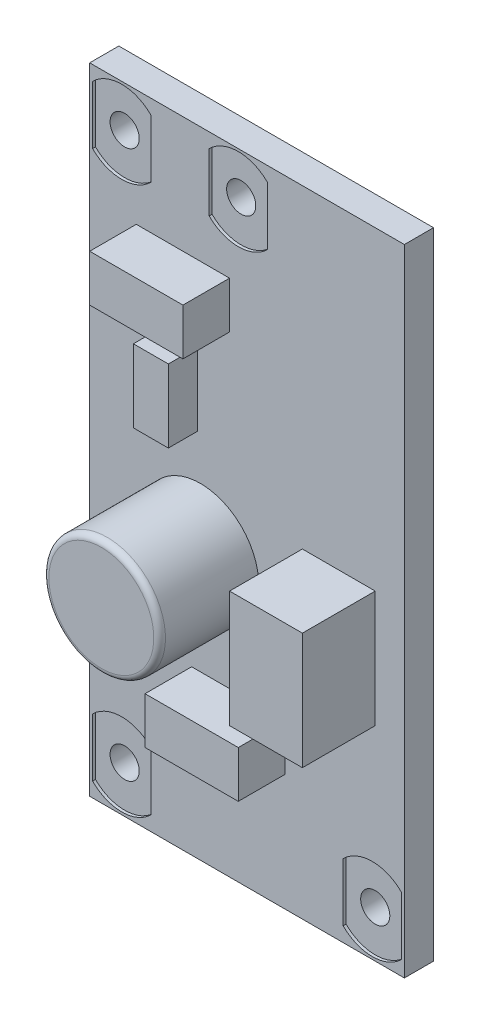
ISO-10303-21;
HEADER;
FILE_DESCRIPTION(('STEP AP214'),'2;1');
FILE_NAME('part.step','',(''),(''),'','','');
FILE_SCHEMA(('AUTOMOTIVE_DESIGN { 1 0 10303 214 1 1 1 1 }'));
ENDSEC;
DATA;
#1=APPLICATION_CONTEXT('core data for automotive mechanical design processes');
#2=APPLICATION_PROTOCOL_DEFINITION('international standard','automotive_design',2000,#1);
#3=PRODUCT_CONTEXT('',#1,'mechanical');
#4=PRODUCT('Part','Part','',(#3));
#5=PRODUCT_RELATED_PRODUCT_CATEGORY('part','',(#4));
#6=PRODUCT_DEFINITION_FORMATION('','',#4);
#7=PRODUCT_DEFINITION_CONTEXT('part definition',#1,'design');
#8=PRODUCT_DEFINITION('design','',#6,#7);
#9=PRODUCT_DEFINITION_SHAPE('','',#8);
#10=(LENGTH_UNIT() NAMED_UNIT(*) SI_UNIT(.MILLI.,.METRE.));
#11=(NAMED_UNIT(*) PLANE_ANGLE_UNIT() SI_UNIT($,.RADIAN.));
#12=(NAMED_UNIT(*) SI_UNIT($,.STERADIAN.) SOLID_ANGLE_UNIT());
#13=UNCERTAINTY_MEASURE_WITH_UNIT(LENGTH_MEASURE(1.E-05),#10,'distance_accuracy_value','');
#14=(GEOMETRIC_REPRESENTATION_CONTEXT(3) GLOBAL_UNCERTAINTY_ASSIGNED_CONTEXT((#13)) GLOBAL_UNIT_ASSIGNED_CONTEXT((#10,
#11,#12)) REPRESENTATION_CONTEXT('',''));
#15=CARTESIAN_POINT('',(0.,0.,0.));
#16=DIRECTION('',(0.,0.,1.));
#17=DIRECTION('',(1.,0.,0.));
#18=AXIS2_PLACEMENT_3D('',#15,#16,#17);
#19=CARTESIAN_POINT('',(5.4,10.9,-1.));
#20=DIRECTION('',(0.,0.,1.));
#21=DIRECTION('',(1.,0.,0.));
#22=AXIS2_PLACEMENT_3D('',#19,#20,#21);
#23=PLANE('',#22);
#24=CARTESIAN_POINT('',(1.1,20.3,-1.));
#25=DIRECTION('',(0.,0.,1.));
#26=DIRECTION('',(-0.707106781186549,-0.707106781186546,0.));
#27=AXIS2_PLACEMENT_3D('',#24,#25,#26);
#28=CIRCLE('',#27,1.41421356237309);
#29=CARTESIAN_POINT('',(0.0999999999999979,19.3,-1.));
#30=VERTEX_POINT('',#29);
#31=CARTESIAN_POINT('',(2.1,19.3,-1.));
#32=VERTEX_POINT('',#31);
#33=EDGE_CURVE('P0_E220',#30,#32,#28,.T.);
#34=ORIENTED_EDGE('',*,*,#33,.T.);
#35=DIRECTION('',(0.,1.,0.));
#36=VECTOR('',#35,1.);
#37=CARTESIAN_POINT('',(2.1,19.3,-1.));
#38=LINE('',#37,#36);
#39=CARTESIAN_POINT('',(2.1,21.3,-1.));
#40=VERTEX_POINT('',#39);
#41=EDGE_CURVE('P0_E354',#32,#40,#38,.T.);
#42=ORIENTED_EDGE('',*,*,#41,.T.);
#43=CARTESIAN_POINT('',(1.1,20.3,-1.));
#44=DIRECTION('',(0.,0.,1.));
#45=DIRECTION('',(0.707106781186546,0.707106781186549,0.));
#46=AXIS2_PLACEMENT_3D('',#43,#44,#45);
#47=CIRCLE('',#46,1.4142135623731);
#48=CARTESIAN_POINT('',(0.0999999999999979,21.3,-1.));
#49=VERTEX_POINT('',#48);
#50=EDGE_CURVE('P0_E365',#40,#49,#47,.T.);
#51=ORIENTED_EDGE('',*,*,#50,.T.);
#52=DIRECTION('',(0.,-1.,0.));
#53=VECTOR('',#52,1.);
#54=CARTESIAN_POINT('',(0.0999999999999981,21.3,-1.));
#55=LINE('',#54,#53);
#56=EDGE_CURVE('P0_E350',#49,#30,#55,.T.);
#57=ORIENTED_EDGE('',*,*,#56,.T.);
#58=EDGE_LOOP('',(#34,#42,#51,#57));
#59=FACE_BOUND('',#58,.T.);
#60=CARTESIAN_POINT('',(5.1,20.3,-1.));
#61=DIRECTION('',(0.,0.,1.));
#62=DIRECTION('',(-0.707106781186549,-0.707106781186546,0.));
#63=AXIS2_PLACEMENT_3D('',#60,#61,#62);
#64=CIRCLE('',#63,1.4142135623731);
#65=CARTESIAN_POINT('',(4.1,19.3,-1.));
#66=VERTEX_POINT('',#65);
#67=CARTESIAN_POINT('',(6.1,19.3,-1.));
#68=VERTEX_POINT('',#67);
#69=EDGE_CURVE('P0_E226',#66,#68,#64,.T.);
#70=ORIENTED_EDGE('',*,*,#69,.T.);
#71=DIRECTION('',(0.,1.,0.));
#72=VECTOR('',#71,1.);
#73=CARTESIAN_POINT('',(6.1,19.3,-1.));
#74=LINE('',#73,#72);
#75=CARTESIAN_POINT('',(6.1,21.3,-1.));
#76=VERTEX_POINT('',#75);
#77=EDGE_CURVE('P0_E408',#68,#76,#74,.T.);
#78=ORIENTED_EDGE('',*,*,#77,.T.);
#79=CARTESIAN_POINT('',(5.1,20.3,-1.));
#80=DIRECTION('',(0.,0.,1.));
#81=DIRECTION('',(0.707106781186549,0.707106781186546,0.));
#82=AXIS2_PLACEMENT_3D('',#79,#80,#81);
#83=CIRCLE('',#82,1.41421356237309);
#84=CARTESIAN_POINT('',(4.1,21.3,-1.));
#85=VERTEX_POINT('',#84);
#86=EDGE_CURVE('P0_E397',#76,#85,#83,.T.);
#87=ORIENTED_EDGE('',*,*,#86,.T.);
#88=DIRECTION('',(0.,-1.,0.));
#89=VECTOR('',#88,1.);
#90=CARTESIAN_POINT('',(4.1,21.3,-1.));
#91=LINE('',#90,#89);
#92=EDGE_CURVE('P0_E387',#85,#66,#91,.T.);
#93=ORIENTED_EDGE('',*,*,#92,.T.);
#94=EDGE_LOOP('',(#70,#78,#87,#93));
#95=FACE_BOUND('',#94,.T.);
#96=CARTESIAN_POINT('',(1.1,1.5,-1.));
#97=DIRECTION('',(0.,0.,1.));
#98=DIRECTION('',(0.707106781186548,0.707106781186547,0.));
#99=AXIS2_PLACEMENT_3D('',#96,#97,#98);
#100=CIRCLE('',#99,1.4142135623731);
#101=CARTESIAN_POINT('',(2.1,2.5,-1.));
#102=VERTEX_POINT('',#101);
#103=CARTESIAN_POINT('',(0.1,2.5,-1.));
#104=VERTEX_POINT('',#103);
#105=EDGE_CURVE('P0_E230',#102,#104,#100,.T.);
#106=ORIENTED_EDGE('',*,*,#105,.T.);
#107=DIRECTION('',(0.,-1.,0.));
#108=VECTOR('',#107,1.);
#109=CARTESIAN_POINT('',(0.100000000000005,0.5,-1.));
#110=LINE('',#109,#108);
#111=CARTESIAN_POINT('',(0.100000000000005,0.5,-1.));
#112=VERTEX_POINT('',#111);
#113=EDGE_CURVE('P0_E332',#104,#112,#110,.T.);
#114=ORIENTED_EDGE('',*,*,#113,.T.);
#115=CARTESIAN_POINT('',(1.1,1.5,-1.));
#116=DIRECTION('',(0.,0.,1.));
#117=DIRECTION('',(-0.707106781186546,-0.707106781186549,0.));
#118=AXIS2_PLACEMENT_3D('',#115,#116,#117);
#119=CIRCLE('',#118,1.41421356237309);
#120=CARTESIAN_POINT('',(2.1,0.5,-1.));
#121=VERTEX_POINT('',#120);
#122=EDGE_CURVE('P0_E306',#112,#121,#119,.T.);
#123=ORIENTED_EDGE('',*,*,#122,.T.);
#124=DIRECTION('',(0.,1.,0.));
#125=VECTOR('',#124,1.);
#126=CARTESIAN_POINT('',(2.1,2.5,-1.));
#127=LINE('',#126,#125);
#128=EDGE_CURVE('P0_E315',#121,#102,#127,.T.);
#129=ORIENTED_EDGE('',*,*,#128,.T.);
#130=EDGE_LOOP('',(#106,#114,#123,#129));
#131=FACE_BOUND('',#130,.T.);
#132=CARTESIAN_POINT('',(9.7,1.5,-1.));
#133=DIRECTION('',(0.,0.,1.));
#134=DIRECTION('',(0.707106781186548,0.707106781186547,0.));
#135=AXIS2_PLACEMENT_3D('',#132,#133,#134);
#136=CIRCLE('',#135,1.41421356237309);
#137=CARTESIAN_POINT('',(10.7,2.5,-1.));
#138=VERTEX_POINT('',#137);
#139=CARTESIAN_POINT('',(8.7,2.5,-1.));
#140=VERTEX_POINT('',#139);
#141=EDGE_CURVE('P0_E197',#138,#140,#136,.T.);
#142=ORIENTED_EDGE('',*,*,#141,.T.);
#143=DIRECTION('',(0.,-1.,0.));
#144=VECTOR('',#143,1.);
#145=CARTESIAN_POINT('',(8.7,2.5,-1.));
#146=LINE('',#145,#144);
#147=CARTESIAN_POINT('',(8.7,0.5,-1.));
#148=VERTEX_POINT('',#147);
#149=EDGE_CURVE('P0_E235',#140,#148,#146,.T.);
#150=ORIENTED_EDGE('',*,*,#149,.T.);
#151=CARTESIAN_POINT('',(9.7,1.5,-1.));
#152=DIRECTION('',(0.,0.,1.));
#153=DIRECTION('',(-0.707106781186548,-0.707106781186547,0.));
#154=AXIS2_PLACEMENT_3D('',#151,#152,#153);
#155=CIRCLE('',#154,1.4142135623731);
#156=CARTESIAN_POINT('',(10.7,0.5,-1.));
#157=VERTEX_POINT('',#156);
#158=EDGE_CURVE('P0_E292',#148,#157,#155,.T.);
#159=ORIENTED_EDGE('',*,*,#158,.T.);
#160=DIRECTION('',(0.,1.,0.));
#161=VECTOR('',#160,1.);
#162=CARTESIAN_POINT('',(10.7,0.5,-1.));
#163=LINE('',#162,#161);
#164=EDGE_CURVE('P0_E238',#157,#138,#163,.T.);
#165=ORIENTED_EDGE('',*,*,#164,.T.);
#166=EDGE_LOOP('',(#142,#150,#159,#165));
#167=FACE_BOUND('',#166,.T.);
#168=DIRECTION('',(0.,1.,0.));
#169=VECTOR('',#168,1.);
#170=CARTESIAN_POINT('',(0.,21.8,-1.));
#171=LINE('',#170,#169);
#172=CARTESIAN_POINT('',(0.,0.,-1.));
#173=VERTEX_POINT('',#172);
#174=CARTESIAN_POINT('',(0.,21.8,-1.));
#175=VERTEX_POINT('',#174);
#176=EDGE_CURVE('P0_E11',#173,#175,#171,.T.);
#177=ORIENTED_EDGE('',*,*,#176,.T.);
#178=DIRECTION('',(1.,0.,0.));
#179=VECTOR('',#178,1.);
#180=CARTESIAN_POINT('',(10.8,21.8,-1.));
#181=LINE('',#180,#179);
#182=CARTESIAN_POINT('',(10.8,21.8,-1.));
#183=VERTEX_POINT('',#182);
#184=EDGE_CURVE('P0_E158',#175,#183,#181,.T.);
#185=ORIENTED_EDGE('',*,*,#184,.T.);
#186=DIRECTION('',(0.,-1.,0.));
#187=VECTOR('',#186,1.);
#188=CARTESIAN_POINT('',(10.8,0.,-1.));
#189=LINE('',#188,#187);
#190=CARTESIAN_POINT('',(10.8,0.,-1.));
#191=VERTEX_POINT('',#190);
#192=EDGE_CURVE('P0_E165',#183,#191,#189,.T.);
#193=ORIENTED_EDGE('',*,*,#192,.T.);
#194=DIRECTION('',(-1.,0.,0.));
#195=VECTOR('',#194,1.);
#196=CARTESIAN_POINT('',(0.,0.,-1.));
#197=LINE('',#196,#195);
#198=EDGE_CURVE('P0_E179',#191,#173,#197,.T.);
#199=ORIENTED_EDGE('',*,*,#198,.T.);
#200=EDGE_LOOP('',(#177,#185,#193,#199));
#201=FACE_BOUND('',#200,.T.);
#202=ADVANCED_FACE('P0_F17',(#59,#95,#131,#167,#201),#23,.F.);
#203=CARTESIAN_POINT('',(5.4,10.9,0.));
#204=DIRECTION('',(0.,0.,1.));
#205=DIRECTION('',(1.,0.,0.));
#206=AXIS2_PLACEMENT_3D('',#203,#204,#205);
#207=PLANE('',#206);
#208=CARTESIAN_POINT('',(1.1,20.3,0.));
#209=DIRECTION('',(0.,0.,-1.));
#210=DIRECTION('',(-0.707106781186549,-0.707106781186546,0.));
#211=AXIS2_PLACEMENT_3D('',#208,#209,#210);
#212=CIRCLE('',#211,1.41421356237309);
#213=CARTESIAN_POINT('',(2.1,19.3,0.));
#214=VERTEX_POINT('',#213);
#215=CARTESIAN_POINT('',(0.0999999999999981,19.3,0.));
#216=VERTEX_POINT('',#215);
#217=EDGE_CURVE('P0_E372',#214,#216,#212,.T.);
#218=ORIENTED_EDGE('',*,*,#217,.T.);
#219=DIRECTION('',(0.,1.,0.));
#220=VECTOR('',#219,1.);
#221=CARTESIAN_POINT('',(0.0999999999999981,21.3,0.));
#222=LINE('',#221,#220);
#223=CARTESIAN_POINT('',(0.0999999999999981,21.3,0.));
#224=VERTEX_POINT('',#223);
#225=EDGE_CURVE('P0_E439',#216,#224,#222,.T.);
#226=ORIENTED_EDGE('',*,*,#225,.T.);
#227=CARTESIAN_POINT('',(1.1,20.3,0.));
#228=DIRECTION('',(0.,0.,-1.));
#229=DIRECTION('',(0.707106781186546,0.707106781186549,0.));
#230=AXIS2_PLACEMENT_3D('',#227,#228,#229);
#231=CIRCLE('',#230,1.4142135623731);
#232=CARTESIAN_POINT('',(2.1,21.3,0.));
#233=VERTEX_POINT('',#232);
#234=EDGE_CURVE('P0_E361',#224,#233,#231,.T.);
#235=ORIENTED_EDGE('',*,*,#234,.T.);
#236=DIRECTION('',(0.,-1.,0.));
#237=VECTOR('',#236,1.);
#238=CARTESIAN_POINT('',(2.1,19.3,0.));
#239=LINE('',#238,#237);
#240=EDGE_CURVE('P0_E348',#233,#214,#239,.T.);
#241=ORIENTED_EDGE('',*,*,#240,.T.);
#242=EDGE_LOOP('',(#218,#226,#235,#241));
#243=FACE_BOUND('',#242,.T.);
#244=CARTESIAN_POINT('',(5.1,20.3,0.));
#245=DIRECTION('',(0.,0.,-1.));
#246=DIRECTION('',(-0.707106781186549,-0.707106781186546,0.));
#247=AXIS2_PLACEMENT_3D('',#244,#245,#246);
#248=CIRCLE('',#247,1.4142135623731);
#249=CARTESIAN_POINT('',(6.1,19.3,0.));
#250=VERTEX_POINT('',#249);
#251=CARTESIAN_POINT('',(4.1,19.3,0.));
#252=VERTEX_POINT('',#251);
#253=EDGE_CURVE('P0_E302',#250,#252,#248,.T.);
#254=ORIENTED_EDGE('',*,*,#253,.T.);
#255=DIRECTION('',(0.,1.,0.));
#256=VECTOR('',#255,1.);
#257=CARTESIAN_POINT('',(4.1,21.3,0.));
#258=LINE('',#257,#256);
#259=CARTESIAN_POINT('',(4.1,21.3,0.));
#260=VERTEX_POINT('',#259);
#261=EDGE_CURVE('P0_E381',#252,#260,#258,.T.);
#262=ORIENTED_EDGE('',*,*,#261,.T.);
#263=CARTESIAN_POINT('',(5.1,20.3,0.));
#264=DIRECTION('',(0.,0.,-1.));
#265=DIRECTION('',(0.707106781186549,0.707106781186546,0.));
#266=AXIS2_PLACEMENT_3D('',#263,#264,#265);
#267=CIRCLE('',#266,1.41421356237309);
#268=CARTESIAN_POINT('',(6.1,21.3,0.));
#269=VERTEX_POINT('',#268);
#270=EDGE_CURVE('P0_E386',#260,#269,#267,.T.);
#271=ORIENTED_EDGE('',*,*,#270,.T.);
#272=DIRECTION('',(0.,-1.,0.));
#273=VECTOR('',#272,1.);
#274=CARTESIAN_POINT('',(6.1,19.3,0.));
#275=LINE('',#274,#273);
#276=EDGE_CURVE('P0_E404',#269,#250,#275,.T.);
#277=ORIENTED_EDGE('',*,*,#276,.T.);
#278=EDGE_LOOP('',(#254,#262,#271,#277));
#279=FACE_BOUND('',#278,.T.);
#280=CARTESIAN_POINT('',(1.1,1.5,0.));
#281=DIRECTION('',(0.,0.,-1.));
#282=DIRECTION('',(0.707106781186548,0.707106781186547,0.));
#283=AXIS2_PLACEMENT_3D('',#280,#281,#282);
#284=CIRCLE('',#283,1.4142135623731);
#285=CARTESIAN_POINT('',(0.1,2.5,0.));
#286=VERTEX_POINT('',#285);
#287=CARTESIAN_POINT('',(2.1,2.5,0.));
#288=VERTEX_POINT('',#287);
#289=EDGE_CURVE('P0_E281',#286,#288,#284,.T.);
#290=ORIENTED_EDGE('',*,*,#289,.T.);
#291=DIRECTION('',(0.,-1.,0.));
#292=VECTOR('',#291,1.);
#293=CARTESIAN_POINT('',(2.1,2.5,0.));
#294=LINE('',#293,#292);
#295=CARTESIAN_POINT('',(2.1,0.5,0.));
#296=VERTEX_POINT('',#295);
#297=EDGE_CURVE('P0_E305',#288,#296,#294,.T.);
#298=ORIENTED_EDGE('',*,*,#297,.T.);
#299=CARTESIAN_POINT('',(1.1,1.5,0.));
#300=DIRECTION('',(0.,0.,-1.));
#301=DIRECTION('',(-0.707106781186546,-0.707106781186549,0.));
#302=AXIS2_PLACEMENT_3D('',#299,#300,#301);
#303=CIRCLE('',#302,1.41421356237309);
#304=CARTESIAN_POINT('',(0.100000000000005,0.5,0.));
#305=VERTEX_POINT('',#304);
#306=EDGE_CURVE('P0_E310',#296,#305,#303,.T.);
#307=ORIENTED_EDGE('',*,*,#306,.T.);
#308=DIRECTION('',(0.,1.,0.));
#309=VECTOR('',#308,1.);
#310=CARTESIAN_POINT('',(0.100000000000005,0.5,0.));
#311=LINE('',#310,#309);
#312=EDGE_CURVE('P0_E328',#305,#286,#311,.T.);
#313=ORIENTED_EDGE('',*,*,#312,.T.);
#314=EDGE_LOOP('',(#290,#298,#307,#313));
#315=FACE_BOUND('',#314,.T.);
#316=CARTESIAN_POINT('',(9.7,1.5,0.));
#317=DIRECTION('',(0.,0.,-1.));
#318=DIRECTION('',(0.707106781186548,0.707106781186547,0.));
#319=AXIS2_PLACEMENT_3D('',#316,#317,#318);
#320=CIRCLE('',#319,1.41421356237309);
#321=CARTESIAN_POINT('',(8.7,2.5,0.));
#322=VERTEX_POINT('',#321);
#323=CARTESIAN_POINT('',(10.7,2.5,0.));
#324=VERTEX_POINT('',#323);
#325=EDGE_CURVE('P0_E201',#322,#324,#320,.T.);
#326=ORIENTED_EDGE('',*,*,#325,.T.);
#327=DIRECTION('',(0.,-1.,0.));
#328=VECTOR('',#327,1.);
#329=CARTESIAN_POINT('',(10.7,0.5,0.));
#330=LINE('',#329,#328);
#331=CARTESIAN_POINT('',(10.7,0.5,0.));
#332=VERTEX_POINT('',#331);
#333=EDGE_CURVE('P0_E267',#324,#332,#330,.T.);
#334=ORIENTED_EDGE('',*,*,#333,.T.);
#335=CARTESIAN_POINT('',(9.7,1.5,0.));
#336=DIRECTION('',(0.,0.,-1.));
#337=DIRECTION('',(-0.707106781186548,-0.707106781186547,0.));
#338=AXIS2_PLACEMENT_3D('',#335,#336,#337);
#339=CIRCLE('',#338,1.4142135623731);
#340=CARTESIAN_POINT('',(8.7,0.5,0.));
#341=VERTEX_POINT('',#340);
#342=EDGE_CURVE('P0_E290',#332,#341,#339,.T.);
#343=ORIENTED_EDGE('',*,*,#342,.T.);
#344=DIRECTION('',(0.,1.,0.));
#345=VECTOR('',#344,1.);
#346=CARTESIAN_POINT('',(8.7,2.5,0.));
#347=LINE('',#346,#345);
#348=EDGE_CURVE('P0_E255',#341,#322,#347,.T.);
#349=ORIENTED_EDGE('',*,*,#348,.T.);
#350=EDGE_LOOP('',(#326,#334,#343,#349));
#351=FACE_BOUND('',#350,.T.);
#352=DIRECTION('',(0.,-1.,0.));
#353=VECTOR('',#352,1.);
#354=CARTESIAN_POINT('',(0.,21.8,0.));
#355=LINE('',#354,#353);
#356=CARTESIAN_POINT('',(0.,21.8,0.));
#357=VERTEX_POINT('',#356);
#358=CARTESIAN_POINT('',(0.,0.,0.));
#359=VERTEX_POINT('',#358);
#360=EDGE_CURVE('P0_E25',#357,#359,#355,.T.);
#361=ORIENTED_EDGE('',*,*,#360,.T.);
#362=DIRECTION('',(1.,0.,0.));
#363=VECTOR('',#362,1.);
#364=CARTESIAN_POINT('',(0.,0.,0.));
#365=LINE('',#364,#363);
#366=CARTESIAN_POINT('',(10.8,0.,0.));
#367=VERTEX_POINT('',#366);
#368=EDGE_CURVE('P0_E171',#359,#367,#365,.T.);
#369=ORIENTED_EDGE('',*,*,#368,.T.);
#370=DIRECTION('',(0.,1.,0.));
#371=VECTOR('',#370,1.);
#372=CARTESIAN_POINT('',(10.8,0.,0.));
#373=LINE('',#372,#371);
#374=CARTESIAN_POINT('',(10.8,21.8,0.));
#375=VERTEX_POINT('',#374);
#376=EDGE_CURVE('P0_E163',#367,#375,#373,.T.);
#377=ORIENTED_EDGE('',*,*,#376,.T.);
#378=DIRECTION('',(-1.,0.,0.));
#379=VECTOR('',#378,1.);
#380=CARTESIAN_POINT('',(10.8,21.8,0.));
#381=LINE('',#380,#379);
#382=EDGE_CURVE('P0_E148',#375,#357,#381,.T.);
#383=ORIENTED_EDGE('',*,*,#382,.T.);
#384=EDGE_LOOP('',(#361,#369,#377,#383));
#385=FACE_BOUND('',#384,.T.);
#386=ADVANCED_FACE('P0_F169',(#243,#279,#315,#351,#385),#207,.T.);
#387=CARTESIAN_POINT('',(0.,0.,0.));
#388=DIRECTION('',(-1.,0.,0.));
#389=DIRECTION('',(0.,0.,1.));
#390=AXIS2_PLACEMENT_3D('',#387,#388,#389);
#391=PLANE('',#390);
#392=ORIENTED_EDGE('',*,*,#360,.F.);
#393=DIRECTION('',(0.,0.,-1.));
#394=VECTOR('',#393,1.);
#395=CARTESIAN_POINT('',(0.,21.8,0.));
#396=LINE('',#395,#394);
#397=EDGE_CURVE('P0_E154',#357,#175,#396,.T.);
#398=ORIENTED_EDGE('',*,*,#397,.T.);
#399=ORIENTED_EDGE('',*,*,#176,.F.);
#400=DIRECTION('',(0.,0.,-1.));
#401=VECTOR('',#400,1.);
#402=CARTESIAN_POINT('',(0.,0.,0.));
#403=LINE('',#402,#401);
#404=EDGE_CURVE('P0_E189',#359,#173,#403,.T.);
#405=ORIENTED_EDGE('',*,*,#404,.F.);
#406=EDGE_LOOP('',(#392,#398,#399,#405));
#407=FACE_BOUND('',#406,.T.);
#408=ADVANCED_FACE('P0_F190',(#407),#391,.T.);
#409=CARTESIAN_POINT('',(0.,21.8,0.));
#410=DIRECTION('',(0.,1.,0.));
#411=DIRECTION('',(1.,0.,0.));
#412=AXIS2_PLACEMENT_3D('',#409,#410,#411);
#413=PLANE('',#412);
#414=ORIENTED_EDGE('',*,*,#382,.F.);
#415=DIRECTION('',(0.,0.,-1.));
#416=VECTOR('',#415,1.);
#417=CARTESIAN_POINT('',(10.8,21.8,0.));
#418=LINE('',#417,#416);
#419=EDGE_CURVE('P0_E152',#375,#183,#418,.T.);
#420=ORIENTED_EDGE('',*,*,#419,.T.);
#421=ORIENTED_EDGE('',*,*,#184,.F.);
#422=ORIENTED_EDGE('',*,*,#397,.F.);
#423=EDGE_LOOP('',(#414,#420,#421,#422));
#424=FACE_BOUND('',#423,.T.);
#425=ADVANCED_FACE('P0_F150',(#424),#413,.T.);
#426=CARTESIAN_POINT('',(10.8,21.8,0.));
#427=DIRECTION('',(1.,0.,0.));
#428=DIRECTION('',(0.,1.,0.));
#429=AXIS2_PLACEMENT_3D('',#426,#427,#428);
#430=PLANE('',#429);
#431=ORIENTED_EDGE('',*,*,#376,.F.);
#432=DIRECTION('',(0.,0.,-1.));
#433=VECTOR('',#432,1.);
#434=CARTESIAN_POINT('',(10.8,0.,0.));
#435=LINE('',#434,#433);
#436=EDGE_CURVE('P0_E173',#367,#191,#435,.T.);
#437=ORIENTED_EDGE('',*,*,#436,.T.);
#438=ORIENTED_EDGE('',*,*,#192,.F.);
#439=ORIENTED_EDGE('',*,*,#419,.F.);
#440=EDGE_LOOP('',(#431,#437,#438,#439));
#441=FACE_BOUND('',#440,.T.);
#442=ADVANCED_FACE('P0_F161',(#441),#430,.T.);
#443=CARTESIAN_POINT('',(10.8,0.,0.));
#444=DIRECTION('',(0.,-1.,0.));
#445=DIRECTION('',(0.,0.,-1.));
#446=AXIS2_PLACEMENT_3D('',#443,#444,#445);
#447=PLANE('',#446);
#448=ORIENTED_EDGE('',*,*,#368,.F.);
#449=ORIENTED_EDGE('',*,*,#404,.T.);
#450=ORIENTED_EDGE('',*,*,#198,.F.);
#451=ORIENTED_EDGE('',*,*,#436,.F.);
#452=EDGE_LOOP('',(#448,#449,#450,#451));
#453=FACE_BOUND('',#452,.T.);
#454=ADVANCED_FACE('P0_F195',(#453),#447,.T.);
#455=CARTESIAN_POINT('',(9.7,1.5,0.));
#456=DIRECTION('',(0.,0.,-1.));
#457=DIRECTION('',(0.707106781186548,0.707106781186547,0.));
#458=AXIS2_PLACEMENT_3D('',#455,#456,#457);
#459=CYLINDRICAL_SURFACE('',#458,1.41421356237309);
#460=ORIENTED_EDGE('',*,*,#325,.F.);
#461=DIRECTION('',(0.,0.,-1.));
#462=VECTOR('',#461,1.);
#463=CARTESIAN_POINT('',(8.7,2.5,0.));
#464=LINE('',#463,#462);
#465=EDGE_CURVE('P0_E243',#322,#140,#464,.T.);
#466=ORIENTED_EDGE('',*,*,#465,.T.);
#467=ORIENTED_EDGE('',*,*,#141,.F.);
#468=DIRECTION('',(0.,0.,-1.));
#469=VECTOR('',#468,1.);
#470=CARTESIAN_POINT('',(10.7,2.5,0.));
#471=LINE('',#470,#469);
#472=EDGE_CURVE('P0_E268',#324,#138,#471,.T.);
#473=ORIENTED_EDGE('',*,*,#472,.F.);
#474=EDGE_LOOP('',(#460,#466,#467,#473));
#475=FACE_BOUND('',#474,.T.);
#476=ADVANCED_FACE('P0_F244',(#475),#459,.F.);
#477=CARTESIAN_POINT('',(8.7,2.5,0.));
#478=DIRECTION('',(1.,0.,0.));
#479=DIRECTION('',(0.,1.,0.));
#480=AXIS2_PLACEMENT_3D('',#477,#478,#479);
#481=PLANE('',#480);
#482=ORIENTED_EDGE('',*,*,#348,.F.);
#483=DIRECTION('',(0.,0.,-1.));
#484=VECTOR('',#483,1.);
#485=CARTESIAN_POINT('',(8.7,0.5,0.));
#486=LINE('',#485,#484);
#487=EDGE_CURVE('P0_E252',#341,#148,#486,.T.);
#488=ORIENTED_EDGE('',*,*,#487,.T.);
#489=ORIENTED_EDGE('',*,*,#149,.F.);
#490=ORIENTED_EDGE('',*,*,#465,.F.);
#491=EDGE_LOOP('',(#482,#488,#489,#490));
#492=FACE_BOUND('',#491,.T.);
#493=ADVANCED_FACE('P0_F250',(#492),#481,.T.);
#494=CARTESIAN_POINT('',(9.7,1.5,0.));
#495=DIRECTION('',(0.,0.,-1.));
#496=DIRECTION('',(-0.707106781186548,-0.707106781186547,0.));
#497=AXIS2_PLACEMENT_3D('',#494,#495,#496);
#498=CYLINDRICAL_SURFACE('',#497,1.4142135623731);
#499=ORIENTED_EDGE('',*,*,#342,.F.);
#500=DIRECTION('',(0.,0.,-1.));
#501=VECTOR('',#500,1.);
#502=CARTESIAN_POINT('',(10.7,0.5,0.));
#503=LINE('',#502,#501);
#504=EDGE_CURVE('P0_E275',#332,#157,#503,.T.);
#505=ORIENTED_EDGE('',*,*,#504,.T.);
#506=ORIENTED_EDGE('',*,*,#158,.F.);
#507=ORIENTED_EDGE('',*,*,#487,.F.);
#508=EDGE_LOOP('',(#499,#505,#506,#507));
#509=FACE_BOUND('',#508,.T.);
#510=ADVANCED_FACE('P0_F532',(#509),#498,.F.);
#511=CARTESIAN_POINT('',(10.7,0.5,0.));
#512=DIRECTION('',(-1.,0.,0.));
#513=DIRECTION('',(0.,0.,1.));
#514=AXIS2_PLACEMENT_3D('',#511,#512,#513);
#515=PLANE('',#514);
#516=ORIENTED_EDGE('',*,*,#333,.F.);
#517=ORIENTED_EDGE('',*,*,#472,.T.);
#518=ORIENTED_EDGE('',*,*,#164,.F.);
#519=ORIENTED_EDGE('',*,*,#504,.F.);
#520=EDGE_LOOP('',(#516,#517,#518,#519));
#521=FACE_BOUND('',#520,.T.);
#522=ADVANCED_FACE('P0_F273',(#521),#515,.T.);
#523=CARTESIAN_POINT('',(1.1,1.5,0.));
#524=DIRECTION('',(0.,0.,-1.));
#525=DIRECTION('',(0.707106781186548,0.707106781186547,0.));
#526=AXIS2_PLACEMENT_3D('',#523,#524,#525);
#527=CYLINDRICAL_SURFACE('',#526,1.4142135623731);
#528=ORIENTED_EDGE('',*,*,#289,.F.);
#529=DIRECTION('',(0.,0.,-1.));
#530=VECTOR('',#529,1.);
#531=CARTESIAN_POINT('',(0.1,2.5,0.));
#532=LINE('',#531,#530);
#533=EDGE_CURVE('P0_E284',#286,#104,#532,.T.);
#534=ORIENTED_EDGE('',*,*,#533,.T.);
#535=ORIENTED_EDGE('',*,*,#105,.F.);
#536=DIRECTION('',(0.,0.,-1.));
#537=VECTOR('',#536,1.);
#538=CARTESIAN_POINT('',(2.1,2.5,0.));
#539=LINE('',#538,#537);
#540=EDGE_CURVE('P0_E314',#288,#102,#539,.T.);
#541=ORIENTED_EDGE('',*,*,#540,.F.);
#542=EDGE_LOOP('',(#528,#534,#535,#541));
#543=FACE_BOUND('',#542,.T.);
#544=ADVANCED_FACE('P0_F531',(#543),#527,.F.);
#545=CARTESIAN_POINT('',(0.1,2.5,0.));
#546=DIRECTION('',(1.,0.,0.));
#547=DIRECTION('',(0.,1.,0.));
#548=AXIS2_PLACEMENT_3D('',#545,#546,#547);
#549=PLANE('',#548);
#550=ORIENTED_EDGE('',*,*,#312,.F.);
#551=DIRECTION('',(0.,0.,-1.));
#552=VECTOR('',#551,1.);
#553=CARTESIAN_POINT('',(0.100000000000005,0.5,0.));
#554=LINE('',#553,#552);
#555=EDGE_CURVE('P0_E309',#305,#112,#554,.T.);
#556=ORIENTED_EDGE('',*,*,#555,.T.);
#557=ORIENTED_EDGE('',*,*,#113,.F.);
#558=ORIENTED_EDGE('',*,*,#533,.F.);
#559=EDGE_LOOP('',(#550,#556,#557,#558));
#560=FACE_BOUND('',#559,.T.);
#561=ADVANCED_FACE('P0_F523',(#560),#549,.T.);
#562=CARTESIAN_POINT('',(1.1,1.5,0.));
#563=DIRECTION('',(0.,0.,-1.));
#564=DIRECTION('',(-0.707106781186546,-0.707106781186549,0.));
#565=AXIS2_PLACEMENT_3D('',#562,#563,#564);
#566=CYLINDRICAL_SURFACE('',#565,1.41421356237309);
#567=ORIENTED_EDGE('',*,*,#306,.F.);
#568=DIRECTION('',(0.,0.,-1.));
#569=VECTOR('',#568,1.);
#570=CARTESIAN_POINT('',(2.1,0.5,0.));
#571=LINE('',#570,#569);
#572=EDGE_CURVE('P0_E318',#296,#121,#571,.T.);
#573=ORIENTED_EDGE('',*,*,#572,.T.);
#574=ORIENTED_EDGE('',*,*,#122,.F.);
#575=ORIENTED_EDGE('',*,*,#555,.F.);
#576=EDGE_LOOP('',(#567,#573,#574,#575));
#577=FACE_BOUND('',#576,.T.);
#578=ADVANCED_FACE('P0_F521',(#577),#566,.F.);
#579=CARTESIAN_POINT('',(2.1,0.5,0.));
#580=DIRECTION('',(-1.,0.,0.));
#581=DIRECTION('',(0.,0.,1.));
#582=AXIS2_PLACEMENT_3D('',#579,#580,#581);
#583=PLANE('',#582);
#584=ORIENTED_EDGE('',*,*,#297,.F.);
#585=ORIENTED_EDGE('',*,*,#540,.T.);
#586=ORIENTED_EDGE('',*,*,#128,.F.);
#587=ORIENTED_EDGE('',*,*,#572,.F.);
#588=EDGE_LOOP('',(#584,#585,#586,#587));
#589=FACE_BOUND('',#588,.T.);
#590=ADVANCED_FACE('P0_F509',(#589),#583,.T.);
#591=CARTESIAN_POINT('',(5.1,20.3,0.));
#592=DIRECTION('',(0.,0.,-1.));
#593=DIRECTION('',(-0.707106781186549,-0.707106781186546,0.));
#594=AXIS2_PLACEMENT_3D('',#591,#592,#593);
#595=CYLINDRICAL_SURFACE('',#594,1.4142135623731);
#596=ORIENTED_EDGE('',*,*,#253,.F.);
#597=DIRECTION('',(0.,0.,-1.));
#598=VECTOR('',#597,1.);
#599=CARTESIAN_POINT('',(6.1,19.3,0.));
#600=LINE('',#599,#598);
#601=EDGE_CURVE('P0_E413',#250,#68,#600,.T.);
#602=ORIENTED_EDGE('',*,*,#601,.T.);
#603=ORIENTED_EDGE('',*,*,#69,.F.);
#604=DIRECTION('',(0.,0.,-1.));
#605=VECTOR('',#604,1.);
#606=CARTESIAN_POINT('',(4.1,19.3,0.));
#607=LINE('',#606,#605);
#608=EDGE_CURVE('P0_E390',#252,#66,#607,.T.);
#609=ORIENTED_EDGE('',*,*,#608,.F.);
#610=EDGE_LOOP('',(#596,#602,#603,#609));
#611=FACE_BOUND('',#610,.T.);
#612=ADVANCED_FACE('P0_F429',(#611),#595,.F.);
#613=CARTESIAN_POINT('',(6.1,19.3,0.));
#614=DIRECTION('',(-1.,0.,0.));
#615=DIRECTION('',(0.,0.,1.));
#616=AXIS2_PLACEMENT_3D('',#613,#614,#615);
#617=PLANE('',#616);
#618=ORIENTED_EDGE('',*,*,#276,.F.);
#619=DIRECTION('',(0.,0.,-1.));
#620=VECTOR('',#619,1.);
#621=CARTESIAN_POINT('',(6.1,21.3,0.));
#622=LINE('',#621,#620);
#623=EDGE_CURVE('P0_E400',#269,#76,#622,.T.);
#624=ORIENTED_EDGE('',*,*,#623,.T.);
#625=ORIENTED_EDGE('',*,*,#77,.F.);
#626=ORIENTED_EDGE('',*,*,#601,.F.);
#627=EDGE_LOOP('',(#618,#624,#625,#626));
#628=FACE_BOUND('',#627,.T.);
#629=ADVANCED_FACE('P0_F500',(#628),#617,.T.);
#630=CARTESIAN_POINT('',(5.1,20.3,0.));
#631=DIRECTION('',(0.,0.,-1.));
#632=DIRECTION('',(0.707106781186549,0.707106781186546,0.));
#633=AXIS2_PLACEMENT_3D('',#630,#631,#632);
#634=CYLINDRICAL_SURFACE('',#633,1.41421356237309);
#635=ORIENTED_EDGE('',*,*,#270,.F.);
#636=DIRECTION('',(0.,0.,-1.));
#637=VECTOR('',#636,1.);
#638=CARTESIAN_POINT('',(4.1,21.3,0.));
#639=LINE('',#638,#637);
#640=EDGE_CURVE('P0_E382',#260,#85,#639,.T.);
#641=ORIENTED_EDGE('',*,*,#640,.T.);
#642=ORIENTED_EDGE('',*,*,#86,.F.);
#643=ORIENTED_EDGE('',*,*,#623,.F.);
#644=EDGE_LOOP('',(#635,#641,#642,#643));
#645=FACE_BOUND('',#644,.T.);
#646=ADVANCED_FACE('P0_F497',(#645),#634,.F.);
#647=CARTESIAN_POINT('',(4.1,21.3,0.));
#648=DIRECTION('',(1.,0.,0.));
#649=DIRECTION('',(0.,1.,0.));
#650=AXIS2_PLACEMENT_3D('',#647,#648,#649);
#651=PLANE('',#650);
#652=ORIENTED_EDGE('',*,*,#261,.F.);
#653=ORIENTED_EDGE('',*,*,#608,.T.);
#654=ORIENTED_EDGE('',*,*,#92,.F.);
#655=ORIENTED_EDGE('',*,*,#640,.F.);
#656=EDGE_LOOP('',(#652,#653,#654,#655));
#657=FACE_BOUND('',#656,.T.);
#658=ADVANCED_FACE('P0_F433',(#657),#651,.T.);
#659=CARTESIAN_POINT('',(1.1,20.3,0.));
#660=DIRECTION('',(0.,0.,-1.));
#661=DIRECTION('',(-0.707106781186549,-0.707106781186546,0.));
#662=AXIS2_PLACEMENT_3D('',#659,#660,#661);
#663=CYLINDRICAL_SURFACE('',#662,1.41421356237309);
#664=ORIENTED_EDGE('',*,*,#217,.F.);
#665=DIRECTION('',(0.,0.,-1.));
#666=VECTOR('',#665,1.);
#667=CARTESIAN_POINT('',(2.1,19.3,0.));
#668=LINE('',#667,#666);
#669=EDGE_CURVE('P0_E357',#214,#32,#668,.T.);
#670=ORIENTED_EDGE('',*,*,#669,.T.);
#671=ORIENTED_EDGE('',*,*,#33,.F.);
#672=DIRECTION('',(0.,0.,-1.));
#673=VECTOR('',#672,1.);
#674=CARTESIAN_POINT('',(0.0999999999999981,19.3,0.));
#675=LINE('',#674,#673);
#676=EDGE_CURVE('P0_E353',#216,#30,#675,.T.);
#677=ORIENTED_EDGE('',*,*,#676,.F.);
#678=EDGE_LOOP('',(#664,#670,#671,#677));
#679=FACE_BOUND('',#678,.T.);
#680=ADVANCED_FACE('P0_F458',(#679),#663,.F.);
#681=CARTESIAN_POINT('',(2.1,19.3,0.));
#682=DIRECTION('',(-1.,0.,0.));
#683=DIRECTION('',(0.,0.,1.));
#684=AXIS2_PLACEMENT_3D('',#681,#682,#683);
#685=PLANE('',#684);
#686=ORIENTED_EDGE('',*,*,#240,.F.);
#687=DIRECTION('',(0.,0.,-1.));
#688=VECTOR('',#687,1.);
#689=CARTESIAN_POINT('',(2.1,21.3,0.));
#690=LINE('',#689,#688);
#691=EDGE_CURVE('P0_E369',#233,#40,#690,.T.);
#692=ORIENTED_EDGE('',*,*,#691,.T.);
#693=ORIENTED_EDGE('',*,*,#41,.F.);
#694=ORIENTED_EDGE('',*,*,#669,.F.);
#695=EDGE_LOOP('',(#686,#692,#693,#694));
#696=FACE_BOUND('',#695,.T.);
#697=ADVANCED_FACE('P0_F515',(#696),#685,.T.);
#698=CARTESIAN_POINT('',(1.1,20.3,0.));
#699=DIRECTION('',(0.,0.,-1.));
#700=DIRECTION('',(0.707106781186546,0.707106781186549,0.));
#701=AXIS2_PLACEMENT_3D('',#698,#699,#700);
#702=CYLINDRICAL_SURFACE('',#701,1.4142135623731);
#703=ORIENTED_EDGE('',*,*,#234,.F.);
#704=DIRECTION('',(0.,0.,-1.));
#705=VECTOR('',#704,1.);
#706=CARTESIAN_POINT('',(0.0999999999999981,21.3,0.));
#707=LINE('',#706,#705);
#708=EDGE_CURVE('P0_E352',#224,#49,#707,.T.);
#709=ORIENTED_EDGE('',*,*,#708,.T.);
#710=ORIENTED_EDGE('',*,*,#50,.F.);
#711=ORIENTED_EDGE('',*,*,#691,.F.);
#712=EDGE_LOOP('',(#703,#709,#710,#711));
#713=FACE_BOUND('',#712,.T.);
#714=ADVANCED_FACE('P0_F513',(#713),#702,.F.);
#715=CARTESIAN_POINT('',(0.0999999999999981,21.3,0.));
#716=DIRECTION('',(1.,0.,0.));
#717=DIRECTION('',(0.,1.,0.));
#718=AXIS2_PLACEMENT_3D('',#715,#716,#717);
#719=PLANE('',#718);
#720=ORIENTED_EDGE('',*,*,#225,.F.);
#721=ORIENTED_EDGE('',*,*,#676,.T.);
#722=ORIENTED_EDGE('',*,*,#56,.F.);
#723=ORIENTED_EDGE('',*,*,#708,.F.);
#724=EDGE_LOOP('',(#720,#721,#722,#723));
#725=FACE_BOUND('',#724,.T.);
#726=ADVANCED_FACE('P0_F449',(#725),#719,.T.);
#727=CLOSED_SHELL('',(#202,#386,#408,#425,#442,#454,#476,#493,#510,#522,#544,#561,#578,#590,
#612,#629,#646,#658,#680,#697,#714,#726));
#728=MANIFOLD_SOLID_BREP('P0_B1',#727);
#729=CARTESIAN_POINT('',(8.55,9.,0.));
#730=DIRECTION('',(0.,0.,1.));
#731=DIRECTION('',(1.,0.,0.));
#732=AXIS2_PLACEMENT_3D('',#729,#730,#731);
#733=PLANE('',#732);
#734=DIRECTION('',(-1.,0.,0.));
#735=VECTOR('',#734,1.);
#736=CARTESIAN_POINT('',(9.8,7.,0.));
#737=LINE('',#736,#735);
#738=CARTESIAN_POINT('',(9.8,7.,0.));
#739=VERTEX_POINT('',#738);
#740=CARTESIAN_POINT('',(7.3,7.,0.));
#741=VERTEX_POINT('',#740);
#742=EDGE_CURVE('P1_E25',#739,#741,#737,.T.);
#743=ORIENTED_EDGE('',*,*,#742,.T.);
#744=DIRECTION('',(0.,1.,0.));
#745=VECTOR('',#744,1.);
#746=CARTESIAN_POINT('',(7.3,7.,0.));
#747=LINE('',#746,#745);
#748=CARTESIAN_POINT('',(7.3,11.,0.));
#749=VERTEX_POINT('',#748);
#750=EDGE_CURVE('P1_E66',#741,#749,#747,.T.);
#751=ORIENTED_EDGE('',*,*,#750,.T.);
#752=DIRECTION('',(1.,0.,0.));
#753=VECTOR('',#752,1.);
#754=CARTESIAN_POINT('',(7.3,11.,0.));
#755=LINE('',#754,#753);
#756=CARTESIAN_POINT('',(9.8,11.,0.));
#757=VERTEX_POINT('',#756);
#758=EDGE_CURVE('P1_E98',#749,#757,#755,.T.);
#759=ORIENTED_EDGE('',*,*,#758,.T.);
#760=DIRECTION('',(0.,-1.,0.));
#761=VECTOR('',#760,1.);
#762=CARTESIAN_POINT('',(9.8,11.,0.));
#763=LINE('',#762,#761);
#764=EDGE_CURVE('P1_E67',#757,#739,#763,.T.);
#765=ORIENTED_EDGE('',*,*,#764,.T.);
#766=EDGE_LOOP('',(#743,#751,#759,#765));
#767=FACE_BOUND('',#766,.T.);
#768=ADVANCED_FACE('P1_F16',(#767),#733,.F.);
#769=CARTESIAN_POINT('',(8.55,9.,2.5));
#770=DIRECTION('',(0.,0.,1.));
#771=DIRECTION('',(1.,0.,0.));
#772=AXIS2_PLACEMENT_3D('',#769,#770,#771);
#773=PLANE('',#772);
#774=DIRECTION('',(1.,0.,0.));
#775=VECTOR('',#774,1.);
#776=CARTESIAN_POINT('',(9.8,7.,2.5));
#777=LINE('',#776,#775);
#778=CARTESIAN_POINT('',(7.3,7.,2.5));
#779=VERTEX_POINT('',#778);
#780=CARTESIAN_POINT('',(9.8,7.,2.5));
#781=VERTEX_POINT('',#780);
#782=EDGE_CURVE('P1_E10',#779,#781,#777,.T.);
#783=ORIENTED_EDGE('',*,*,#782,.T.);
#784=DIRECTION('',(0.,1.,0.));
#785=VECTOR('',#784,1.);
#786=CARTESIAN_POINT('',(9.8,11.,2.5));
#787=LINE('',#786,#785);
#788=CARTESIAN_POINT('',(9.8,11.,2.5));
#789=VERTEX_POINT('',#788);
#790=EDGE_CURVE('P1_E91',#781,#789,#787,.T.);
#791=ORIENTED_EDGE('',*,*,#790,.T.);
#792=DIRECTION('',(-1.,0.,0.));
#793=VECTOR('',#792,1.);
#794=CARTESIAN_POINT('',(7.3,11.,2.5));
#795=LINE('',#794,#793);
#796=CARTESIAN_POINT('',(7.3,11.,2.5));
#797=VERTEX_POINT('',#796);
#798=EDGE_CURVE('P1_E101',#789,#797,#795,.T.);
#799=ORIENTED_EDGE('',*,*,#798,.T.);
#800=DIRECTION('',(0.,-1.,0.));
#801=VECTOR('',#800,1.);
#802=CARTESIAN_POINT('',(7.3,7.,2.5));
#803=LINE('',#802,#801);
#804=EDGE_CURVE('P1_E78',#797,#779,#803,.T.);
#805=ORIENTED_EDGE('',*,*,#804,.T.);
#806=EDGE_LOOP('',(#783,#791,#799,#805));
#807=FACE_BOUND('',#806,.T.);
#808=ADVANCED_FACE('P1_F111',(#807),#773,.T.);
#809=CARTESIAN_POINT('',(7.3,7.,0.));
#810=DIRECTION('',(0.,-1.,0.));
#811=DIRECTION('',(0.,0.,-1.));
#812=AXIS2_PLACEMENT_3D('',#809,#810,#811);
#813=PLANE('',#812);
#814=ORIENTED_EDGE('',*,*,#742,.F.);
#815=DIRECTION('',(0.,0.,1.));
#816=VECTOR('',#815,1.);
#817=CARTESIAN_POINT('',(9.8,7.,0.));
#818=LINE('',#817,#816);
#819=EDGE_CURVE('P1_E71',#739,#781,#818,.T.);
#820=ORIENTED_EDGE('',*,*,#819,.T.);
#821=ORIENTED_EDGE('',*,*,#782,.F.);
#822=DIRECTION('',(0.,0.,1.));
#823=VECTOR('',#822,1.);
#824=CARTESIAN_POINT('',(7.3,7.,0.));
#825=LINE('',#824,#823);
#826=EDGE_CURVE('P1_E73',#741,#779,#825,.T.);
#827=ORIENTED_EDGE('',*,*,#826,.F.);
#828=EDGE_LOOP('',(#814,#820,#821,#827));
#829=FACE_BOUND('',#828,.T.);
#830=ADVANCED_FACE('P1_F74',(#829),#813,.T.);
#831=CARTESIAN_POINT('',(9.8,7.,0.));
#832=DIRECTION('',(1.,0.,0.));
#833=DIRECTION('',(0.,1.,0.));
#834=AXIS2_PLACEMENT_3D('',#831,#832,#833);
#835=PLANE('',#834);
#836=ORIENTED_EDGE('',*,*,#764,.F.);
#837=DIRECTION('',(0.,0.,1.));
#838=VECTOR('',#837,1.);
#839=CARTESIAN_POINT('',(9.8,11.,0.));
#840=LINE('',#839,#838);
#841=EDGE_CURVE('P1_E92',#757,#789,#840,.T.);
#842=ORIENTED_EDGE('',*,*,#841,.T.);
#843=ORIENTED_EDGE('',*,*,#790,.F.);
#844=ORIENTED_EDGE('',*,*,#819,.F.);
#845=EDGE_LOOP('',(#836,#842,#843,#844));
#846=FACE_BOUND('',#845,.T.);
#847=ADVANCED_FACE('P1_F115',(#846),#835,.T.);
#848=CARTESIAN_POINT('',(9.8,11.,0.));
#849=DIRECTION('',(0.,1.,0.));
#850=DIRECTION('',(1.,0.,0.));
#851=AXIS2_PLACEMENT_3D('',#848,#849,#850);
#852=PLANE('',#851);
#853=ORIENTED_EDGE('',*,*,#758,.F.);
#854=DIRECTION('',(0.,0.,1.));
#855=VECTOR('',#854,1.);
#856=CARTESIAN_POINT('',(7.3,11.,0.));
#857=LINE('',#856,#855);
#858=EDGE_CURVE('P1_E83',#749,#797,#857,.T.);
#859=ORIENTED_EDGE('',*,*,#858,.T.);
#860=ORIENTED_EDGE('',*,*,#798,.F.);
#861=ORIENTED_EDGE('',*,*,#841,.F.);
#862=EDGE_LOOP('',(#853,#859,#860,#861));
#863=FACE_BOUND('',#862,.T.);
#864=ADVANCED_FACE('P1_F117',(#863),#852,.T.);
#865=CARTESIAN_POINT('',(7.3,11.,0.));
#866=DIRECTION('',(-1.,0.,0.));
#867=DIRECTION('',(0.,0.,1.));
#868=AXIS2_PLACEMENT_3D('',#865,#866,#867);
#869=PLANE('',#868);
#870=ORIENTED_EDGE('',*,*,#750,.F.);
#871=ORIENTED_EDGE('',*,*,#826,.T.);
#872=ORIENTED_EDGE('',*,*,#804,.F.);
#873=ORIENTED_EDGE('',*,*,#858,.F.);
#874=EDGE_LOOP('',(#870,#871,#872,#873));
#875=FACE_BOUND('',#874,.T.);
#876=ADVANCED_FACE('P1_F81',(#875),#869,.T.);
#877=CLOSED_SHELL('',(#768,#808,#830,#847,#864,#876));
#878=MANIFOLD_SOLID_BREP('P1_B1',#877);
#879=CARTESIAN_POINT('',(9.7,1.5,-0.9));
#880=DIRECTION('',(0.,0.,1.));
#881=DIRECTION('',(1.,0.,0.));
#882=AXIS2_PLACEMENT_3D('',#879,#880,#881);
#883=PLANE('',#882);
#884=CARTESIAN_POINT('',(9.7,1.5,-0.9));
#885=DIRECTION('',(0.,0.,1.));
#886=DIRECTION('',(1.,0.,0.));
#887=AXIS2_PLACEMENT_3D('',#884,#885,#886);
#888=CIRCLE('',#887,0.5);
#889=CARTESIAN_POINT('',(9.2,1.5,-0.9));
#890=VERTEX_POINT('',#889);
#891=EDGE_CURVE('P2_E81',#890,#890,#888,.T.);
#892=ORIENTED_EDGE('',*,*,#891,.T.);
#893=EDGE_LOOP('',(#892));
#894=FACE_BOUND('',#893,.T.);
#895=CARTESIAN_POINT('',(9.7,1.5,-0.9));
#896=DIRECTION('',(0.,0.,-1.));
#897=DIRECTION('',(0.707106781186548,0.707106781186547,0.));
#898=AXIS2_PLACEMENT_3D('',#895,#896,#897);
#899=CIRCLE('',#898,1.41421356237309);
#900=CARTESIAN_POINT('',(8.7,2.5,-0.9));
#901=VERTEX_POINT('',#900);
#902=CARTESIAN_POINT('',(10.7,2.5,-0.9));
#903=VERTEX_POINT('',#902);
#904=EDGE_CURVE('P2_E11',#901,#903,#899,.T.);
#905=ORIENTED_EDGE('',*,*,#904,.T.);
#906=DIRECTION('',(0.,-1.,0.));
#907=VECTOR('',#906,1.);
#908=CARTESIAN_POINT('',(10.7,0.5,-0.9));
#909=LINE('',#908,#907);
#910=CARTESIAN_POINT('',(10.7,0.5,-0.9));
#911=VERTEX_POINT('',#910);
#912=EDGE_CURVE('P2_E101',#903,#911,#909,.T.);
#913=ORIENTED_EDGE('',*,*,#912,.T.);
#914=CARTESIAN_POINT('',(9.7,1.5,-0.9));
#915=DIRECTION('',(0.,0.,-1.));
#916=DIRECTION('',(-0.707106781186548,-0.707106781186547,0.));
#917=AXIS2_PLACEMENT_3D('',#914,#915,#916);
#918=CIRCLE('',#917,1.4142135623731);
#919=CARTESIAN_POINT('',(8.7,0.5,-0.9));
#920=VERTEX_POINT('',#919);
#921=EDGE_CURVE('P2_E95',#911,#920,#918,.T.);
#922=ORIENTED_EDGE('',*,*,#921,.T.);
#923=DIRECTION('',(0.,1.,0.));
#924=VECTOR('',#923,1.);
#925=CARTESIAN_POINT('',(8.7,2.5,-0.9));
#926=LINE('',#925,#924);
#927=EDGE_CURVE('P2_E113',#920,#901,#926,.T.);
#928=ORIENTED_EDGE('',*,*,#927,.T.);
#929=EDGE_LOOP('',(#905,#913,#922,#928));
#930=FACE_BOUND('',#929,.T.);
#931=ADVANCED_FACE('P2_F17',(#894,#930),#883,.F.);
#932=CARTESIAN_POINT('',(9.7,1.5,-0.1));
#933=DIRECTION('',(0.,0.,1.));
#934=DIRECTION('',(1.,0.,0.));
#935=AXIS2_PLACEMENT_3D('',#932,#933,#934);
#936=PLANE('',#935);
#937=CARTESIAN_POINT('',(9.7,1.5,-0.1));
#938=DIRECTION('',(0.,0.,-1.));
#939=DIRECTION('',(1.,0.,0.));
#940=AXIS2_PLACEMENT_3D('',#937,#938,#939);
#941=CIRCLE('',#940,0.5);
#942=CARTESIAN_POINT('',(9.2,1.5,-0.1));
#943=VERTEX_POINT('',#942);
#944=EDGE_CURVE('P2_E82',#943,#943,#941,.T.);
#945=ORIENTED_EDGE('',*,*,#944,.T.);
#946=EDGE_LOOP('',(#945));
#947=FACE_BOUND('',#946,.T.);
#948=CARTESIAN_POINT('',(9.7,1.5,-0.1));
#949=DIRECTION('',(0.,0.,1.));
#950=DIRECTION('',(0.707106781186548,0.707106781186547,0.));
#951=AXIS2_PLACEMENT_3D('',#948,#949,#950);
#952=CIRCLE('',#951,1.41421356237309);
#953=CARTESIAN_POINT('',(10.7,2.5,-0.1));
#954=VERTEX_POINT('',#953);
#955=CARTESIAN_POINT('',(8.7,2.5,-0.1));
#956=VERTEX_POINT('',#955);
#957=EDGE_CURVE('P2_E25',#954,#956,#952,.T.);
#958=ORIENTED_EDGE('',*,*,#957,.T.);
#959=DIRECTION('',(0.,-1.,0.));
#960=VECTOR('',#959,1.);
#961=CARTESIAN_POINT('',(8.7,2.5,-0.1));
#962=LINE('',#961,#960);
#963=CARTESIAN_POINT('',(8.7,0.5,-0.1));
#964=VERTEX_POINT('',#963);
#965=EDGE_CURVE('P2_E105',#956,#964,#962,.T.);
#966=ORIENTED_EDGE('',*,*,#965,.T.);
#967=CARTESIAN_POINT('',(9.7,1.5,-0.1));
#968=DIRECTION('',(0.,0.,1.));
#969=DIRECTION('',(-0.707106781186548,-0.707106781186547,0.));
#970=AXIS2_PLACEMENT_3D('',#967,#968,#969);
#971=CIRCLE('',#970,1.4142135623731);
#972=CARTESIAN_POINT('',(10.7,0.5,-0.1));
#973=VERTEX_POINT('',#972);
#974=EDGE_CURVE('P2_E93',#964,#973,#971,.T.);
#975=ORIENTED_EDGE('',*,*,#974,.T.);
#976=DIRECTION('',(0.,1.,0.));
#977=VECTOR('',#976,1.);
#978=CARTESIAN_POINT('',(10.7,0.5,-0.1));
#979=LINE('',#978,#977);
#980=EDGE_CURVE('P2_E104',#973,#954,#979,.T.);
#981=ORIENTED_EDGE('',*,*,#980,.T.);
#982=EDGE_LOOP('',(#958,#966,#975,#981));
#983=FACE_BOUND('',#982,.T.);
#984=ADVANCED_FACE('P2_F130',(#947,#983),#936,.T.);
#985=CARTESIAN_POINT('',(9.7,1.5,-0.1));
#986=DIRECTION('',(0.,0.,-1.));
#987=DIRECTION('',(0.707106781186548,0.707106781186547,0.));
#988=AXIS2_PLACEMENT_3D('',#985,#986,#987);
#989=CYLINDRICAL_SURFACE('',#988,1.41421356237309);
#990=ORIENTED_EDGE('',*,*,#957,.F.);
#991=DIRECTION('',(0.,0.,-1.));
#992=VECTOR('',#991,1.);
#993=CARTESIAN_POINT('',(10.7,2.5,-0.1));
#994=LINE('',#993,#992);
#995=EDGE_CURVE('P2_E98',#954,#903,#994,.T.);
#996=ORIENTED_EDGE('',*,*,#995,.T.);
#997=ORIENTED_EDGE('',*,*,#904,.F.);
#998=DIRECTION('',(0.,0.,-1.));
#999=VECTOR('',#998,1.);
#1000=CARTESIAN_POINT('',(8.7,2.5,-0.1));
#1001=LINE('',#1000,#999);
#1002=EDGE_CURVE('P2_E109',#956,#901,#1001,.T.);
#1003=ORIENTED_EDGE('',*,*,#1002,.F.);
#1004=EDGE_LOOP('',(#990,#996,#997,#1003));
#1005=FACE_BOUND('',#1004,.T.);
#1006=ADVANCED_FACE('P2_F132',(#1005),#989,.T.);
#1007=CARTESIAN_POINT('',(10.7,2.5,-0.1));
#1008=DIRECTION('',(1.,0.,0.));
#1009=DIRECTION('',(0.,-1.,0.));
#1010=AXIS2_PLACEMENT_3D('',#1007,#1008,#1009);
#1011=PLANE('',#1010);
#1012=ORIENTED_EDGE('',*,*,#980,.F.);
#1013=DIRECTION('',(0.,0.,-1.));
#1014=VECTOR('',#1013,1.);
#1015=CARTESIAN_POINT('',(10.7,0.5,-0.1));
#1016=LINE('',#1015,#1014);
#1017=EDGE_CURVE('P2_E119',#973,#911,#1016,.T.);
#1018=ORIENTED_EDGE('',*,*,#1017,.T.);
#1019=ORIENTED_EDGE('',*,*,#912,.F.);
#1020=ORIENTED_EDGE('',*,*,#995,.F.);
#1021=EDGE_LOOP('',(#1012,#1018,#1019,#1020));
#1022=FACE_BOUND('',#1021,.T.);
#1023=ADVANCED_FACE('P2_F143',(#1022),#1011,.T.);
#1024=CARTESIAN_POINT('',(9.7,1.5,-0.1));
#1025=DIRECTION('',(0.,0.,-1.));
#1026=DIRECTION('',(-0.707106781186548,-0.707106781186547,0.));
#1027=AXIS2_PLACEMENT_3D('',#1024,#1025,#1026);
#1028=CYLINDRICAL_SURFACE('',#1027,1.4142135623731);
#1029=ORIENTED_EDGE('',*,*,#974,.F.);
#1030=DIRECTION('',(0.,0.,-1.));
#1031=VECTOR('',#1030,1.);
#1032=CARTESIAN_POINT('',(8.7,0.5,-0.1));
#1033=LINE('',#1032,#1031);
#1034=EDGE_CURVE('P2_E96',#964,#920,#1033,.T.);
#1035=ORIENTED_EDGE('',*,*,#1034,.T.);
#1036=ORIENTED_EDGE('',*,*,#921,.F.);
#1037=ORIENTED_EDGE('',*,*,#1017,.F.);
#1038=EDGE_LOOP('',(#1029,#1035,#1036,#1037));
#1039=FACE_BOUND('',#1038,.T.);
#1040=ADVANCED_FACE('P2_F139',(#1039),#1028,.T.);
#1041=CARTESIAN_POINT('',(8.7,0.5,-0.1));
#1042=DIRECTION('',(-1.,0.,0.));
#1043=DIRECTION('',(0.,0.,1.));
#1044=AXIS2_PLACEMENT_3D('',#1041,#1042,#1043);
#1045=PLANE('',#1044);
#1046=ORIENTED_EDGE('',*,*,#965,.F.);
#1047=ORIENTED_EDGE('',*,*,#1002,.T.);
#1048=ORIENTED_EDGE('',*,*,#927,.F.);
#1049=ORIENTED_EDGE('',*,*,#1034,.F.);
#1050=EDGE_LOOP('',(#1046,#1047,#1048,#1049));
#1051=FACE_BOUND('',#1050,.T.);
#1052=ADVANCED_FACE('P2_F136',(#1051),#1045,.T.);
#1053=CARTESIAN_POINT('',(9.7,1.5,-0.1));
#1054=DIRECTION('',(0.,0.,-1.));
#1055=DIRECTION('',(1.,0.,0.));
#1056=AXIS2_PLACEMENT_3D('',#1053,#1054,#1055);
#1057=CYLINDRICAL_SURFACE('',#1056,0.5);
#1058=ORIENTED_EDGE('',*,*,#891,.F.);
#1059=DIRECTION('',(0.,0.,1.));
#1060=VECTOR('',#1059,1.);
#1061=CARTESIAN_POINT('',(9.2,1.5,-0.1));
#1062=LINE('',#1061,#1060);
#1063=EDGE_CURVE('P2_E78',#890,#943,#1062,.T.);
#1064=ORIENTED_EDGE('',*,*,#1063,.T.);
#1065=ORIENTED_EDGE('',*,*,#944,.F.);
#1066=ORIENTED_EDGE('',*,*,#1063,.F.);
#1067=EDGE_LOOP('',(#1058,#1064,#1065,#1066));
#1068=FACE_BOUND('',#1067,.T.);
#1069=ADVANCED_FACE('P2_F80',(#1068),#1057,.F.);
#1070=CLOSED_SHELL('',(#931,#984,#1006,#1023,#1040,#1052,#1069));
#1071=MANIFOLD_SOLID_BREP('P2_B1',#1070);
#1072=CARTESIAN_POINT('',(5.1,20.3,-0.9));
#1073=DIRECTION('',(0.,0.,1.));
#1074=DIRECTION('',(1.,0.,0.));
#1075=AXIS2_PLACEMENT_3D('',#1072,#1073,#1074);
#1076=PLANE('',#1075);
#1077=CARTESIAN_POINT('',(5.1,20.3,-0.9));
#1078=DIRECTION('',(0.,0.,1.));
#1079=DIRECTION('',(1.,0.,0.));
#1080=AXIS2_PLACEMENT_3D('',#1077,#1078,#1079);
#1081=CIRCLE('',#1080,0.5);
#1082=CARTESIAN_POINT('',(4.6,20.3,-0.9));
#1083=VERTEX_POINT('',#1082);
#1084=EDGE_CURVE('P3_E155',#1083,#1083,#1081,.T.);
#1085=ORIENTED_EDGE('',*,*,#1084,.T.);
#1086=EDGE_LOOP('',(#1085));
#1087=FACE_BOUND('',#1086,.T.);
#1088=CARTESIAN_POINT('',(5.1,20.3,-0.9));
#1089=DIRECTION('',(0.,0.,-1.));
#1090=DIRECTION('',(-0.707106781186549,-0.707106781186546,0.));
#1091=AXIS2_PLACEMENT_3D('',#1088,#1089,#1090);
#1092=CIRCLE('',#1091,1.4142135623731);
#1093=CARTESIAN_POINT('',(6.1,19.3,-0.9));
#1094=VERTEX_POINT('',#1093);
#1095=CARTESIAN_POINT('',(4.1,19.3,-0.9));
#1096=VERTEX_POINT('',#1095);
#1097=EDGE_CURVE('P3_E11',#1094,#1096,#1092,.T.);
#1098=ORIENTED_EDGE('',*,*,#1097,.T.);
#1099=DIRECTION('',(0.,1.,0.));
#1100=VECTOR('',#1099,1.);
#1101=CARTESIAN_POINT('',(4.1,21.3,-0.9));
#1102=LINE('',#1101,#1100);
#1103=CARTESIAN_POINT('',(4.1,21.3,-0.9));
#1104=VERTEX_POINT('',#1103);
#1105=EDGE_CURVE('P3_E126',#1096,#1104,#1102,.T.);
#1106=ORIENTED_EDGE('',*,*,#1105,.T.);
#1107=CARTESIAN_POINT('',(5.1,20.3,-0.9));
#1108=DIRECTION('',(0.,0.,-1.));
#1109=DIRECTION('',(0.707106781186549,0.707106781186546,0.));
#1110=AXIS2_PLACEMENT_3D('',#1107,#1108,#1109);
#1111=CIRCLE('',#1110,1.41421356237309);
#1112=CARTESIAN_POINT('',(6.1,21.3,-0.9));
#1113=VERTEX_POINT('',#1112);
#1114=EDGE_CURVE('P3_E66',#1104,#1113,#1111,.T.);
#1115=ORIENTED_EDGE('',*,*,#1114,.T.);
#1116=DIRECTION('',(0.,-1.,0.));
#1117=VECTOR('',#1116,1.);
#1118=CARTESIAN_POINT('',(6.1,19.3,-0.9));
#1119=LINE('',#1118,#1117);
#1120=EDGE_CURVE('P3_E101',#1113,#1094,#1119,.T.);
#1121=ORIENTED_EDGE('',*,*,#1120,.T.);
#1122=EDGE_LOOP('',(#1098,#1106,#1115,#1121));
#1123=FACE_BOUND('',#1122,.T.);
#1124=ADVANCED_FACE('P3_F17',(#1087,#1123),#1076,.F.);
#1125=CARTESIAN_POINT('',(5.1,20.3,-0.1));
#1126=DIRECTION('',(0.,0.,1.));
#1127=DIRECTION('',(1.,0.,0.));
#1128=AXIS2_PLACEMENT_3D('',#1125,#1126,#1127);
#1129=PLANE('',#1128);
#1130=CARTESIAN_POINT('',(5.1,20.3,-0.1));
#1131=DIRECTION('',(0.,0.,-1.));
#1132=DIRECTION('',(1.,0.,0.));
#1133=AXIS2_PLACEMENT_3D('',#1130,#1131,#1132);
#1134=CIRCLE('',#1133,0.5);
#1135=CARTESIAN_POINT('',(4.6,20.3,-0.1));
#1136=VERTEX_POINT('',#1135);
#1137=EDGE_CURVE('P3_E107',#1136,#1136,#1134,.T.);
#1138=ORIENTED_EDGE('',*,*,#1137,.T.);
#1139=EDGE_LOOP('',(#1138));
#1140=FACE_BOUND('',#1139,.T.);
#1141=CARTESIAN_POINT('',(5.1,20.3,-0.1));
#1142=DIRECTION('',(0.,0.,1.));
#1143=DIRECTION('',(-0.707106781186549,-0.707106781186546,0.));
#1144=AXIS2_PLACEMENT_3D('',#1141,#1142,#1143);
#1145=CIRCLE('',#1144,1.4142135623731);
#1146=CARTESIAN_POINT('',(4.1,19.3,-0.1));
#1147=VERTEX_POINT('',#1146);
#1148=CARTESIAN_POINT('',(6.1,19.3,-0.1));
#1149=VERTEX_POINT('',#1148);
#1150=EDGE_CURVE('P3_E27',#1147,#1149,#1145,.T.);
#1151=ORIENTED_EDGE('',*,*,#1150,.T.);
#1152=DIRECTION('',(0.,1.,0.));
#1153=VECTOR('',#1152,1.);
#1154=CARTESIAN_POINT('',(6.1,19.3,-0.1));
#1155=LINE('',#1154,#1153);
#1156=CARTESIAN_POINT('',(6.1,21.3,-0.1));
#1157=VERTEX_POINT('',#1156);
#1158=EDGE_CURVE('P3_E100',#1149,#1157,#1155,.T.);
#1159=ORIENTED_EDGE('',*,*,#1158,.T.);
#1160=CARTESIAN_POINT('',(5.1,20.3,-0.1));
#1161=DIRECTION('',(0.,0.,1.));
#1162=DIRECTION('',(0.707106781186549,0.707106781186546,0.));
#1163=AXIS2_PLACEMENT_3D('',#1160,#1161,#1162);
#1164=CIRCLE('',#1163,1.41421356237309);
#1165=CARTESIAN_POINT('',(4.1,21.3,-0.1));
#1166=VERTEX_POINT('',#1165);
#1167=EDGE_CURVE('P3_E88',#1157,#1166,#1164,.T.);
#1168=ORIENTED_EDGE('',*,*,#1167,.T.);
#1169=DIRECTION('',(0.,-1.,0.));
#1170=VECTOR('',#1169,1.);
#1171=CARTESIAN_POINT('',(4.1,21.3,-0.1));
#1172=LINE('',#1171,#1170);
#1173=EDGE_CURVE('P3_E56',#1166,#1147,#1172,.T.);
#1174=ORIENTED_EDGE('',*,*,#1173,.T.);
#1175=EDGE_LOOP('',(#1151,#1159,#1168,#1174));
#1176=FACE_BOUND('',#1175,.T.);
#1177=ADVANCED_FACE('P3_F104',(#1140,#1176),#1129,.T.);
#1178=CARTESIAN_POINT('',(5.1,20.3,-0.1));
#1179=DIRECTION('',(0.,0.,-1.));
#1180=DIRECTION('',(-0.707106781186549,-0.707106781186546,0.));
#1181=AXIS2_PLACEMENT_3D('',#1178,#1179,#1180);
#1182=CYLINDRICAL_SURFACE('',#1181,1.4142135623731);
#1183=ORIENTED_EDGE('',*,*,#1150,.F.);
#1184=DIRECTION('',(0.,0.,-1.));
#1185=VECTOR('',#1184,1.);
#1186=CARTESIAN_POINT('',(4.1,19.3,-0.1));
#1187=LINE('',#1186,#1185);
#1188=EDGE_CURVE('P3_E20',#1147,#1096,#1187,.T.);
#1189=ORIENTED_EDGE('',*,*,#1188,.T.);
#1190=ORIENTED_EDGE('',*,*,#1097,.F.);
#1191=DIRECTION('',(0.,0.,-1.));
#1192=VECTOR('',#1191,1.);
#1193=CARTESIAN_POINT('',(6.1,19.3,-0.1));
#1194=LINE('',#1193,#1192);
#1195=EDGE_CURVE('P3_E106',#1149,#1094,#1194,.T.);
#1196=ORIENTED_EDGE('',*,*,#1195,.F.);
#1197=EDGE_LOOP('',(#1183,#1189,#1190,#1196));
#1198=FACE_BOUND('',#1197,.T.);
#1199=ADVANCED_FACE('P3_F134',(#1198),#1182,.T.);
#1200=CARTESIAN_POINT('',(4.1,19.3,-0.1));
#1201=DIRECTION('',(-1.,0.,0.));
#1202=DIRECTION('',(0.,0.,1.));
#1203=AXIS2_PLACEMENT_3D('',#1200,#1201,#1202);
#1204=PLANE('',#1203);
#1205=ORIENTED_EDGE('',*,*,#1173,.F.);
#1206=DIRECTION('',(0.,0.,-1.));
#1207=VECTOR('',#1206,1.);
#1208=CARTESIAN_POINT('',(4.1,21.3,-0.1));
#1209=LINE('',#1208,#1207);
#1210=EDGE_CURVE('P3_E93',#1166,#1104,#1209,.T.);
#1211=ORIENTED_EDGE('',*,*,#1210,.T.);
#1212=ORIENTED_EDGE('',*,*,#1105,.F.);
#1213=ORIENTED_EDGE('',*,*,#1188,.F.);
#1214=EDGE_LOOP('',(#1205,#1211,#1212,#1213));
#1215=FACE_BOUND('',#1214,.T.);
#1216=ADVANCED_FACE('P3_F135',(#1215),#1204,.T.);
#1217=CARTESIAN_POINT('',(5.1,20.3,-0.1));
#1218=DIRECTION('',(0.,0.,-1.));
#1219=DIRECTION('',(0.707106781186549,0.707106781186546,0.));
#1220=AXIS2_PLACEMENT_3D('',#1217,#1218,#1219);
#1221=CYLINDRICAL_SURFACE('',#1220,1.41421356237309);
#1222=ORIENTED_EDGE('',*,*,#1167,.F.);
#1223=DIRECTION('',(0.,0.,-1.));
#1224=VECTOR('',#1223,1.);
#1225=CARTESIAN_POINT('',(6.1,21.3,-0.1));
#1226=LINE('',#1225,#1224);
#1227=EDGE_CURVE('P3_E91',#1157,#1113,#1226,.T.);
#1228=ORIENTED_EDGE('',*,*,#1227,.T.);
#1229=ORIENTED_EDGE('',*,*,#1114,.F.);
#1230=ORIENTED_EDGE('',*,*,#1210,.F.);
#1231=EDGE_LOOP('',(#1222,#1228,#1229,#1230));
#1232=FACE_BOUND('',#1231,.T.);
#1233=ADVANCED_FACE('P3_F90',(#1232),#1221,.T.);
#1234=CARTESIAN_POINT('',(6.1,21.3,-0.1));
#1235=DIRECTION('',(1.,0.,0.));
#1236=DIRECTION('',(0.,1.,0.));
#1237=AXIS2_PLACEMENT_3D('',#1234,#1235,#1236);
#1238=PLANE('',#1237);
#1239=ORIENTED_EDGE('',*,*,#1158,.F.);
#1240=ORIENTED_EDGE('',*,*,#1195,.T.);
#1241=ORIENTED_EDGE('',*,*,#1120,.F.);
#1242=ORIENTED_EDGE('',*,*,#1227,.F.);
#1243=EDGE_LOOP('',(#1239,#1240,#1241,#1242));
#1244=FACE_BOUND('',#1243,.T.);
#1245=ADVANCED_FACE('P3_F98',(#1244),#1238,.T.);
#1246=CARTESIAN_POINT('',(5.1,20.3,-0.1));
#1247=DIRECTION('',(0.,0.,-1.));
#1248=DIRECTION('',(1.,0.,0.));
#1249=AXIS2_PLACEMENT_3D('',#1246,#1247,#1248);
#1250=CYLINDRICAL_SURFACE('',#1249,0.5);
#1251=ORIENTED_EDGE('',*,*,#1084,.F.);
#1252=DIRECTION('',(0.,0.,1.));
#1253=VECTOR('',#1252,1.);
#1254=CARTESIAN_POINT('',(4.6,20.3,-0.1));
#1255=LINE('',#1254,#1253);
#1256=EDGE_CURVE('P3_E113',#1083,#1136,#1255,.T.);
#1257=ORIENTED_EDGE('',*,*,#1256,.T.);
#1258=ORIENTED_EDGE('',*,*,#1137,.F.);
#1259=ORIENTED_EDGE('',*,*,#1256,.F.);
#1260=EDGE_LOOP('',(#1251,#1257,#1258,#1259));
#1261=FACE_BOUND('',#1260,.T.);
#1262=ADVANCED_FACE('P3_F164',(#1261),#1250,.F.);
#1263=CLOSED_SHELL('',(#1124,#1177,#1199,#1216,#1233,#1245,#1262));
#1264=MANIFOLD_SOLID_BREP('P3_B1',#1263);
#1265=CARTESIAN_POINT('',(1.1,1.5,-0.9));
#1266=DIRECTION('',(0.,0.,1.));
#1267=DIRECTION('',(1.,0.,0.));
#1268=AXIS2_PLACEMENT_3D('',#1265,#1266,#1267);
#1269=PLANE('',#1268);
#1270=CARTESIAN_POINT('',(1.1,1.5,-0.9));
#1271=DIRECTION('',(0.,0.,1.));
#1272=DIRECTION('',(1.,0.,0.));
#1273=AXIS2_PLACEMENT_3D('',#1270,#1271,#1272);
#1274=CIRCLE('',#1273,0.5);
#1275=CARTESIAN_POINT('',(0.6,1.5,-0.9));
#1276=VERTEX_POINT('',#1275);
#1277=EDGE_CURVE('P4_E127',#1276,#1276,#1274,.T.);
#1278=ORIENTED_EDGE('',*,*,#1277,.T.);
#1279=EDGE_LOOP('',(#1278));
#1280=FACE_BOUND('',#1279,.T.);
#1281=CARTESIAN_POINT('',(1.1,1.5,-0.9));
#1282=DIRECTION('',(0.,0.,-1.));
#1283=DIRECTION('',(0.707106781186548,0.707106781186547,0.));
#1284=AXIS2_PLACEMENT_3D('',#1281,#1282,#1283);
#1285=CIRCLE('',#1284,1.4142135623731);
#1286=CARTESIAN_POINT('',(0.1,2.5,-0.9));
#1287=VERTEX_POINT('',#1286);
#1288=CARTESIAN_POINT('',(2.1,2.5,-0.9));
#1289=VERTEX_POINT('',#1288);
#1290=EDGE_CURVE('P4_E11',#1287,#1289,#1285,.T.);
#1291=ORIENTED_EDGE('',*,*,#1290,.T.);
#1292=DIRECTION('',(0.,-1.,0.));
#1293=VECTOR('',#1292,1.);
#1294=CARTESIAN_POINT('',(2.1,2.5,-0.9));
#1295=LINE('',#1294,#1293);
#1296=CARTESIAN_POINT('',(2.1,0.5,-0.9));
#1297=VERTEX_POINT('',#1296);
#1298=EDGE_CURVE('P4_E83',#1289,#1297,#1295,.T.);
#1299=ORIENTED_EDGE('',*,*,#1298,.T.);
#1300=CARTESIAN_POINT('',(1.1,1.5,-0.9));
#1301=DIRECTION('',(0.,0.,-1.));
#1302=DIRECTION('',(-0.707106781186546,-0.707106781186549,0.));
#1303=AXIS2_PLACEMENT_3D('',#1300,#1301,#1302);
#1304=CIRCLE('',#1303,1.41421356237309);
#1305=CARTESIAN_POINT('',(0.100000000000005,0.5,-0.9));
#1306=VERTEX_POINT('',#1305);
#1307=EDGE_CURVE('P4_E77',#1297,#1306,#1304,.T.);
#1308=ORIENTED_EDGE('',*,*,#1307,.T.);
#1309=DIRECTION('',(0.,1.,0.));
#1310=VECTOR('',#1309,1.);
#1311=CARTESIAN_POINT('',(0.100000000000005,0.5,-0.9));
#1312=LINE('',#1311,#1310);
#1313=EDGE_CURVE('P4_E80',#1306,#1287,#1312,.T.);
#1314=ORIENTED_EDGE('',*,*,#1313,.T.);
#1315=EDGE_LOOP('',(#1291,#1299,#1308,#1314));
#1316=FACE_BOUND('',#1315,.T.);
#1317=ADVANCED_FACE('P4_F17',(#1280,#1316),#1269,.F.);
#1318=CARTESIAN_POINT('',(1.1,1.5,-0.1));
#1319=DIRECTION('',(0.,0.,1.));
#1320=DIRECTION('',(1.,0.,0.));
#1321=AXIS2_PLACEMENT_3D('',#1318,#1319,#1320);
#1322=PLANE('',#1321);
#1323=CARTESIAN_POINT('',(1.1,1.5,-0.1));
#1324=DIRECTION('',(0.,0.,-1.));
#1325=DIRECTION('',(1.,0.,0.));
#1326=AXIS2_PLACEMENT_3D('',#1323,#1324,#1325);
#1327=CIRCLE('',#1326,0.5);
#1328=CARTESIAN_POINT('',(0.6,1.5,-0.1));
#1329=VERTEX_POINT('',#1328);
#1330=EDGE_CURVE('P4_E112',#1329,#1329,#1327,.T.);
#1331=ORIENTED_EDGE('',*,*,#1330,.T.);
#1332=EDGE_LOOP('',(#1331));
#1333=FACE_BOUND('',#1332,.T.);
#1334=CARTESIAN_POINT('',(1.1,1.5,-0.1));
#1335=DIRECTION('',(0.,0.,1.));
#1336=DIRECTION('',(0.707106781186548,0.707106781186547,0.));
#1337=AXIS2_PLACEMENT_3D('',#1334,#1335,#1336);
#1338=CIRCLE('',#1337,1.4142135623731);
#1339=CARTESIAN_POINT('',(2.1,2.5,-0.1));
#1340=VERTEX_POINT('',#1339);
#1341=CARTESIAN_POINT('',(0.1,2.5,-0.1));
#1342=VERTEX_POINT('',#1341);
#1343=EDGE_CURVE('P4_E21',#1340,#1342,#1338,.T.);
#1344=ORIENTED_EDGE('',*,*,#1343,.T.);
#1345=DIRECTION('',(0.,1.,0.));
#1346=VECTOR('',#1345,1.);
#1347=CARTESIAN_POINT('',(0.100000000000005,0.5,-0.1));
#1348=LINE('',#1347,#1346);
#1349=CARTESIAN_POINT('',(0.100000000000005,0.5,-0.1));
#1350=VERTEX_POINT('',#1349);
#1351=EDGE_CURVE('P4_E108',#1350,#1342,#1348,.T.);
#1352=ORIENTED_EDGE('',*,*,#1351,.F.);
#1353=CARTESIAN_POINT('',(1.1,1.5,-0.1));
#1354=DIRECTION('',(0.,0.,1.));
#1355=DIRECTION('',(-0.707106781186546,-0.707106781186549,0.));
#1356=AXIS2_PLACEMENT_3D('',#1353,#1354,#1355);
#1357=CIRCLE('',#1356,1.41421356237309);
#1358=CARTESIAN_POINT('',(2.1,0.5,-0.1));
#1359=VERTEX_POINT('',#1358);
#1360=EDGE_CURVE('P4_E89',#1350,#1359,#1357,.T.);
#1361=ORIENTED_EDGE('',*,*,#1360,.T.);
#1362=DIRECTION('',(0.,-1.,0.));
#1363=VECTOR('',#1362,1.);
#1364=CARTESIAN_POINT('',(2.1,2.5,-0.1));
#1365=LINE('',#1364,#1363);
#1366=EDGE_CURVE('P4_E117',#1340,#1359,#1365,.T.);
#1367=ORIENTED_EDGE('',*,*,#1366,.F.);
#1368=EDGE_LOOP('',(#1344,#1352,#1361,#1367));
#1369=FACE_BOUND('',#1368,.T.);
#1370=ADVANCED_FACE('P4_F19',(#1333,#1369),#1322,.T.);
#1371=CARTESIAN_POINT('',(1.1,1.5,-0.1));
#1372=DIRECTION('',(0.,0.,-1.));
#1373=DIRECTION('',(0.707106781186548,0.707106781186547,0.));
#1374=AXIS2_PLACEMENT_3D('',#1371,#1372,#1373);
#1375=CYLINDRICAL_SURFACE('',#1374,1.4142135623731);
#1376=ORIENTED_EDGE('',*,*,#1343,.F.);
#1377=DIRECTION('',(0.,0.,-1.));
#1378=VECTOR('',#1377,1.);
#1379=CARTESIAN_POINT('',(2.1,2.5,-0.1));
#1380=LINE('',#1379,#1378);
#1381=EDGE_CURVE('P4_E119',#1340,#1289,#1380,.T.);
#1382=ORIENTED_EDGE('',*,*,#1381,.T.);
#1383=ORIENTED_EDGE('',*,*,#1290,.F.);
#1384=DIRECTION('',(0.,0.,-1.));
#1385=VECTOR('',#1384,1.);
#1386=CARTESIAN_POINT('',(0.1,2.5,-0.1));
#1387=LINE('',#1386,#1385);
#1388=EDGE_CURVE('P4_E101',#1342,#1287,#1387,.T.);
#1389=ORIENTED_EDGE('',*,*,#1388,.F.);
#1390=EDGE_LOOP('',(#1376,#1382,#1383,#1389));
#1391=FACE_BOUND('',#1390,.T.);
#1392=ADVANCED_FACE('P4_F151',(#1391),#1375,.T.);
#1393=CARTESIAN_POINT('',(2.1,2.5,-0.1));
#1394=DIRECTION('',(1.,0.,0.));
#1395=DIRECTION('',(0.,1.,0.));
#1396=AXIS2_PLACEMENT_3D('',#1393,#1394,#1395);
#1397=PLANE('',#1396);
#1398=ORIENTED_EDGE('',*,*,#1366,.T.);
#1399=DIRECTION('',(0.,0.,-1.));
#1400=VECTOR('',#1399,1.);
#1401=CARTESIAN_POINT('',(2.1,0.5,-0.1));
#1402=LINE('',#1401,#1400);
#1403=EDGE_CURVE('P4_E88',#1359,#1297,#1402,.T.);
#1404=ORIENTED_EDGE('',*,*,#1403,.T.);
#1405=ORIENTED_EDGE('',*,*,#1298,.F.);
#1406=ORIENTED_EDGE('',*,*,#1381,.F.);
#1407=EDGE_LOOP('',(#1398,#1404,#1405,#1406));
#1408=FACE_BOUND('',#1407,.T.);
#1409=ADVANCED_FACE('P4_F155',(#1408),#1397,.T.);
#1410=CARTESIAN_POINT('',(1.1,1.5,-0.1));
#1411=DIRECTION('',(0.,0.,-1.));
#1412=DIRECTION('',(-0.707106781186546,-0.707106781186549,0.));
#1413=AXIS2_PLACEMENT_3D('',#1410,#1411,#1412);
#1414=CYLINDRICAL_SURFACE('',#1413,1.41421356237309);
#1415=ORIENTED_EDGE('',*,*,#1360,.F.);
#1416=DIRECTION('',(0.,0.,-1.));
#1417=VECTOR('',#1416,1.);
#1418=CARTESIAN_POINT('',(0.100000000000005,0.5,-0.1));
#1419=LINE('',#1418,#1417);
#1420=EDGE_CURVE('P4_E92',#1350,#1306,#1419,.T.);
#1421=ORIENTED_EDGE('',*,*,#1420,.T.);
#1422=ORIENTED_EDGE('',*,*,#1307,.F.);
#1423=ORIENTED_EDGE('',*,*,#1403,.F.);
#1424=EDGE_LOOP('',(#1415,#1421,#1422,#1423));
#1425=FACE_BOUND('',#1424,.T.);
#1426=ADVANCED_FACE('P4_F93',(#1425),#1414,.T.);
#1427=CARTESIAN_POINT('',(0.100000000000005,0.5,-0.1));
#1428=DIRECTION('',(-1.,0.,0.));
#1429=DIRECTION('',(0.,1.,0.));
#1430=AXIS2_PLACEMENT_3D('',#1427,#1428,#1429);
#1431=PLANE('',#1430);
#1432=ORIENTED_EDGE('',*,*,#1351,.T.);
#1433=ORIENTED_EDGE('',*,*,#1388,.T.);
#1434=ORIENTED_EDGE('',*,*,#1313,.F.);
#1435=ORIENTED_EDGE('',*,*,#1420,.F.);
#1436=EDGE_LOOP('',(#1432,#1433,#1434,#1435));
#1437=FACE_BOUND('',#1436,.T.);
#1438=ADVANCED_FACE('P4_F100',(#1437),#1431,.T.);
#1439=CARTESIAN_POINT('',(1.1,1.5,-0.1));
#1440=DIRECTION('',(0.,0.,-1.));
#1441=DIRECTION('',(1.,0.,0.));
#1442=AXIS2_PLACEMENT_3D('',#1439,#1440,#1441);
#1443=CYLINDRICAL_SURFACE('',#1442,0.5);
#1444=ORIENTED_EDGE('',*,*,#1277,.F.);
#1445=DIRECTION('',(0.,0.,1.));
#1446=VECTOR('',#1445,1.);
#1447=CARTESIAN_POINT('',(0.6,1.5,-0.1));
#1448=LINE('',#1447,#1446);
#1449=EDGE_CURVE('P4_E131',#1276,#1329,#1448,.T.);
#1450=ORIENTED_EDGE('',*,*,#1449,.T.);
#1451=ORIENTED_EDGE('',*,*,#1330,.F.);
#1452=ORIENTED_EDGE('',*,*,#1449,.F.);
#1453=EDGE_LOOP('',(#1444,#1450,#1451,#1452));
#1454=FACE_BOUND('',#1453,.T.);
#1455=ADVANCED_FACE('P4_F142',(#1454),#1443,.F.);
#1456=CLOSED_SHELL('',(#1317,#1370,#1392,#1409,#1426,#1438,#1455));
#1457=MANIFOLD_SOLID_BREP('P4_B1',#1456);
#1458=CARTESIAN_POINT('',(1.1,20.3,-0.9));
#1459=DIRECTION('',(0.,0.,1.));
#1460=DIRECTION('',(1.,0.,0.));
#1461=AXIS2_PLACEMENT_3D('',#1458,#1459,#1460);
#1462=PLANE('',#1461);
#1463=CARTESIAN_POINT('',(1.1,20.3,-0.9));
#1464=DIRECTION('',(0.,0.,1.));
#1465=DIRECTION('',(1.,0.,0.));
#1466=AXIS2_PLACEMENT_3D('',#1463,#1464,#1465);
#1467=CIRCLE('',#1466,0.5);
#1468=CARTESIAN_POINT('',(0.6,20.3,-0.9));
#1469=VERTEX_POINT('',#1468);
#1470=EDGE_CURVE('P5_E88',#1469,#1469,#1467,.T.);
#1471=ORIENTED_EDGE('',*,*,#1470,.T.);
#1472=EDGE_LOOP('',(#1471));
#1473=FACE_BOUND('',#1472,.T.);
#1474=CARTESIAN_POINT('',(1.1,20.3,-0.9));
#1475=DIRECTION('',(0.,0.,-1.));
#1476=DIRECTION('',(-0.707106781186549,-0.707106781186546,0.));
#1477=AXIS2_PLACEMENT_3D('',#1474,#1475,#1476);
#1478=CIRCLE('',#1477,1.41421356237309);
#1479=CARTESIAN_POINT('',(2.1,19.3,-0.9));
#1480=VERTEX_POINT('',#1479);
#1481=CARTESIAN_POINT('',(0.0999999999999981,19.3,-0.9));
#1482=VERTEX_POINT('',#1481);
#1483=EDGE_CURVE('P5_E11',#1480,#1482,#1478,.T.);
#1484=ORIENTED_EDGE('',*,*,#1483,.T.);
#1485=DIRECTION('',(0.,1.,0.));
#1486=VECTOR('',#1485,1.);
#1487=CARTESIAN_POINT('',(0.0999999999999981,21.3,-0.9));
#1488=LINE('',#1487,#1486);
#1489=CARTESIAN_POINT('',(0.0999999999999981,21.3,-0.9));
#1490=VERTEX_POINT('',#1489);
#1491=EDGE_CURVE('P5_E104',#1482,#1490,#1488,.T.);
#1492=ORIENTED_EDGE('',*,*,#1491,.T.);
#1493=CARTESIAN_POINT('',(1.1,20.3,-0.9));
#1494=DIRECTION('',(0.,0.,-1.));
#1495=DIRECTION('',(0.707106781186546,0.707106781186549,0.));
#1496=AXIS2_PLACEMENT_3D('',#1493,#1494,#1495);
#1497=CIRCLE('',#1496,1.4142135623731);
#1498=CARTESIAN_POINT('',(2.1,21.3,-0.9));
#1499=VERTEX_POINT('',#1498);
#1500=EDGE_CURVE('P5_E103',#1490,#1499,#1497,.T.);
#1501=ORIENTED_EDGE('',*,*,#1500,.T.);
#1502=DIRECTION('',(0.,-1.,0.));
#1503=VECTOR('',#1502,1.);
#1504=CARTESIAN_POINT('',(2.1,19.3,-0.9));
#1505=LINE('',#1504,#1503);
#1506=EDGE_CURVE('P5_E93',#1499,#1480,#1505,.T.);
#1507=ORIENTED_EDGE('',*,*,#1506,.T.);
#1508=EDGE_LOOP('',(#1484,#1492,#1501,#1507));
#1509=FACE_BOUND('',#1508,.T.);
#1510=ADVANCED_FACE('P5_F17',(#1473,#1509),#1462,.F.);
#1511=CARTESIAN_POINT('',(1.1,20.3,-0.1));
#1512=DIRECTION('',(0.,0.,1.));
#1513=DIRECTION('',(1.,0.,0.));
#1514=AXIS2_PLACEMENT_3D('',#1511,#1512,#1513);
#1515=PLANE('',#1514);
#1516=CARTESIAN_POINT('',(1.1,20.3,-0.1));
#1517=DIRECTION('',(0.,0.,-1.));
#1518=DIRECTION('',(1.,0.,0.));
#1519=AXIS2_PLACEMENT_3D('',#1516,#1517,#1518);
#1520=CIRCLE('',#1519,0.5);
#1521=CARTESIAN_POINT('',(0.6,20.3,-0.1));
#1522=VERTEX_POINT('',#1521);
#1523=EDGE_CURVE('P5_E72',#1522,#1522,#1520,.T.);
#1524=ORIENTED_EDGE('',*,*,#1523,.T.);
#1525=EDGE_LOOP('',(#1524));
#1526=FACE_BOUND('',#1525,.T.);
#1527=CARTESIAN_POINT('',(1.1,20.3,-0.1));
#1528=DIRECTION('',(0.,0.,1.));
#1529=DIRECTION('',(-0.707106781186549,-0.707106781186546,0.));
#1530=AXIS2_PLACEMENT_3D('',#1527,#1528,#1529);
#1531=CIRCLE('',#1530,1.41421356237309);
#1532=CARTESIAN_POINT('',(0.0999999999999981,19.3,-0.1));
#1533=VERTEX_POINT('',#1532);
#1534=CARTESIAN_POINT('',(2.1,19.3,-0.1));
#1535=VERTEX_POINT('',#1534);
#1536=EDGE_CURVE('P5_E20',#1533,#1535,#1531,.T.);
#1537=ORIENTED_EDGE('',*,*,#1536,.T.);
#1538=DIRECTION('',(0.,1.,0.));
#1539=VECTOR('',#1538,1.);
#1540=CARTESIAN_POINT('',(2.1,19.3,-0.1));
#1541=LINE('',#1540,#1539);
#1542=CARTESIAN_POINT('',(2.1,21.3,-0.1));
#1543=VERTEX_POINT('',#1542);
#1544=EDGE_CURVE('P5_E78',#1535,#1543,#1541,.T.);
#1545=ORIENTED_EDGE('',*,*,#1544,.T.);
#1546=CARTESIAN_POINT('',(1.1,20.3,-0.1));
#1547=DIRECTION('',(0.,0.,1.));
#1548=DIRECTION('',(0.707106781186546,0.707106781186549,0.));
#1549=AXIS2_PLACEMENT_3D('',#1546,#1547,#1548);
#1550=CIRCLE('',#1549,1.4142135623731);
#1551=CARTESIAN_POINT('',(0.0999999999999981,21.3,-0.1));
#1552=VERTEX_POINT('',#1551);
#1553=EDGE_CURVE('P5_E99',#1543,#1552,#1550,.T.);
#1554=ORIENTED_EDGE('',*,*,#1553,.T.);
#1555=DIRECTION('',(0.,-1.,0.));
#1556=VECTOR('',#1555,1.);
#1557=CARTESIAN_POINT('',(0.0999999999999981,21.3,-0.1));
#1558=LINE('',#1557,#1556);
#1559=EDGE_CURVE('P5_E108',#1552,#1533,#1558,.T.);
#1560=ORIENTED_EDGE('',*,*,#1559,.T.);
#1561=EDGE_LOOP('',(#1537,#1545,#1554,#1560));
#1562=FACE_BOUND('',#1561,.T.);
#1563=ADVANCED_FACE('P5_F73',(#1526,#1562),#1515,.T.);
#1564=CARTESIAN_POINT('',(1.1,20.3,-0.1));
#1565=DIRECTION('',(0.,0.,-1.));
#1566=DIRECTION('',(-0.707106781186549,-0.707106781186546,0.));
#1567=AXIS2_PLACEMENT_3D('',#1564,#1565,#1566);
#1568=CYLINDRICAL_SURFACE('',#1567,1.41421356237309);
#1569=ORIENTED_EDGE('',*,*,#1536,.F.);
#1570=DIRECTION('',(0.,0.,-1.));
#1571=VECTOR('',#1570,1.);
#1572=CARTESIAN_POINT('',(0.0999999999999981,19.3,-0.1));
#1573=LINE('',#1572,#1571);
#1574=EDGE_CURVE('P5_E107',#1533,#1482,#1573,.T.);
#1575=ORIENTED_EDGE('',*,*,#1574,.T.);
#1576=ORIENTED_EDGE('',*,*,#1483,.F.);
#1577=DIRECTION('',(0.,0.,-1.));
#1578=VECTOR('',#1577,1.);
#1579=CARTESIAN_POINT('',(2.1,19.3,-0.1));
#1580=LINE('',#1579,#1578);
#1581=EDGE_CURVE('P5_E85',#1535,#1480,#1580,.T.);
#1582=ORIENTED_EDGE('',*,*,#1581,.F.);
#1583=EDGE_LOOP('',(#1569,#1575,#1576,#1582));
#1584=FACE_BOUND('',#1583,.T.);
#1585=ADVANCED_FACE('P5_F127',(#1584),#1568,.T.);
#1586=CARTESIAN_POINT('',(0.0999999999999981,19.3,-0.1));
#1587=DIRECTION('',(-1.,0.,0.));
#1588=DIRECTION('',(0.,0.,1.));
#1589=AXIS2_PLACEMENT_3D('',#1586,#1587,#1588);
#1590=PLANE('',#1589);
#1591=ORIENTED_EDGE('',*,*,#1559,.F.);
#1592=DIRECTION('',(0.,0.,-1.));
#1593=VECTOR('',#1592,1.);
#1594=CARTESIAN_POINT('',(0.0999999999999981,21.3,-0.1));
#1595=LINE('',#1594,#1593);
#1596=EDGE_CURVE('P5_E112',#1552,#1490,#1595,.T.);
#1597=ORIENTED_EDGE('',*,*,#1596,.T.);
#1598=ORIENTED_EDGE('',*,*,#1491,.F.);
#1599=ORIENTED_EDGE('',*,*,#1574,.F.);
#1600=EDGE_LOOP('',(#1591,#1597,#1598,#1599));
#1601=FACE_BOUND('',#1600,.T.);
#1602=ADVANCED_FACE('P5_F165',(#1601),#1590,.T.);
#1603=CARTESIAN_POINT('',(1.1,20.3,-0.1));
#1604=DIRECTION('',(0.,0.,-1.));
#1605=DIRECTION('',(0.707106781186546,0.707106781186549,0.));
#1606=AXIS2_PLACEMENT_3D('',#1603,#1604,#1605);
#1607=CYLINDRICAL_SURFACE('',#1606,1.4142135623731);
#1608=ORIENTED_EDGE('',*,*,#1553,.F.);
#1609=DIRECTION('',(0.,0.,-1.));
#1610=VECTOR('',#1609,1.);
#1611=CARTESIAN_POINT('',(2.1,21.3,-0.1));
#1612=LINE('',#1611,#1610);
#1613=EDGE_CURVE('P5_E91',#1543,#1499,#1612,.T.);
#1614=ORIENTED_EDGE('',*,*,#1613,.T.);
#1615=ORIENTED_EDGE('',*,*,#1500,.F.);
#1616=ORIENTED_EDGE('',*,*,#1596,.F.);
#1617=EDGE_LOOP('',(#1608,#1614,#1615,#1616));
#1618=FACE_BOUND('',#1617,.T.);
#1619=ADVANCED_FACE('P5_F153',(#1618),#1607,.T.);
#1620=CARTESIAN_POINT('',(2.1,21.3,-0.1));
#1621=DIRECTION('',(1.,0.,0.));
#1622=DIRECTION('',(0.,-1.,0.));
#1623=AXIS2_PLACEMENT_3D('',#1620,#1621,#1622);
#1624=PLANE('',#1623);
#1625=ORIENTED_EDGE('',*,*,#1544,.F.);
#1626=ORIENTED_EDGE('',*,*,#1581,.T.);
#1627=ORIENTED_EDGE('',*,*,#1506,.F.);
#1628=ORIENTED_EDGE('',*,*,#1613,.F.);
#1629=EDGE_LOOP('',(#1625,#1626,#1627,#1628));
#1630=FACE_BOUND('',#1629,.T.);
#1631=ADVANCED_FACE('P5_F131',(#1630),#1624,.T.);
#1632=CARTESIAN_POINT('',(1.1,20.3,-0.1));
#1633=DIRECTION('',(0.,0.,-1.));
#1634=DIRECTION('',(1.,0.,0.));
#1635=AXIS2_PLACEMENT_3D('',#1632,#1633,#1634);
#1636=CYLINDRICAL_SURFACE('',#1635,0.5);
#1637=ORIENTED_EDGE('',*,*,#1470,.F.);
#1638=DIRECTION('',(0.,0.,1.));
#1639=VECTOR('',#1638,1.);
#1640=CARTESIAN_POINT('',(0.6,20.3,-0.1));
#1641=LINE('',#1640,#1639);
#1642=EDGE_CURVE('P5_E79',#1469,#1522,#1641,.T.);
#1643=ORIENTED_EDGE('',*,*,#1642,.T.);
#1644=ORIENTED_EDGE('',*,*,#1523,.F.);
#1645=ORIENTED_EDGE('',*,*,#1642,.F.);
#1646=EDGE_LOOP('',(#1637,#1643,#1644,#1645));
#1647=FACE_BOUND('',#1646,.T.);
#1648=ADVANCED_FACE('P5_F145',(#1647),#1636,.F.);
#1649=CLOSED_SHELL('',(#1510,#1563,#1585,#1602,#1619,#1631,#1648));
#1650=MANIFOLD_SOLID_BREP('P5_B1',#1649);
#1651=CARTESIAN_POINT('',(3.2,17.,0.));
#1652=DIRECTION('',(0.,0.,1.));
#1653=DIRECTION('',(1.,0.,0.));
#1654=AXIS2_PLACEMENT_3D('',#1651,#1652,#1653);
#1655=PLANE('',#1654);
#1656=DIRECTION('',(-1.,0.,0.));
#1657=VECTOR('',#1656,1.);
#1658=CARTESIAN_POINT('',(4.8,16.2,0.));
#1659=LINE('',#1658,#1657);
#1660=CARTESIAN_POINT('',(4.8,16.2,0.));
#1661=VERTEX_POINT('',#1660);
#1662=CARTESIAN_POINT('',(1.6,16.2,0.));
#1663=VERTEX_POINT('',#1662);
#1664=EDGE_CURVE('P6_E25',#1661,#1663,#1659,.T.);
#1665=ORIENTED_EDGE('',*,*,#1664,.T.);
#1666=DIRECTION('',(0.,1.,0.));
#1667=VECTOR('',#1666,1.);
#1668=CARTESIAN_POINT('',(1.6,16.2,0.));
#1669=LINE('',#1668,#1667);
#1670=CARTESIAN_POINT('',(1.6,17.8,0.));
#1671=VERTEX_POINT('',#1670);
#1672=EDGE_CURVE('P6_E91',#1663,#1671,#1669,.T.);
#1673=ORIENTED_EDGE('',*,*,#1672,.T.);
#1674=DIRECTION('',(1.,0.,0.));
#1675=VECTOR('',#1674,1.);
#1676=CARTESIAN_POINT('',(1.6,17.8,0.));
#1677=LINE('',#1676,#1675);
#1678=CARTESIAN_POINT('',(4.8,17.8,0.));
#1679=VERTEX_POINT('',#1678);
#1680=EDGE_CURVE('P6_E84',#1671,#1679,#1677,.T.);
#1681=ORIENTED_EDGE('',*,*,#1680,.T.);
#1682=DIRECTION('',(0.,-1.,0.));
#1683=VECTOR('',#1682,1.);
#1684=CARTESIAN_POINT('',(4.8,17.8,0.));
#1685=LINE('',#1684,#1683);
#1686=EDGE_CURVE('P6_E69',#1679,#1661,#1685,.T.);
#1687=ORIENTED_EDGE('',*,*,#1686,.T.);
#1688=EDGE_LOOP('',(#1665,#1673,#1681,#1687));
#1689=FACE_BOUND('',#1688,.T.);
#1690=ADVANCED_FACE('P6_F17',(#1689),#1655,.F.);
#1691=CARTESIAN_POINT('',(3.2,17.,1.6));
#1692=DIRECTION('',(0.,0.,1.));
#1693=DIRECTION('',(1.,0.,0.));
#1694=AXIS2_PLACEMENT_3D('',#1691,#1692,#1693);
#1695=PLANE('',#1694);
#1696=DIRECTION('',(1.,0.,0.));
#1697=VECTOR('',#1696,1.);
#1698=CARTESIAN_POINT('',(4.8,16.2,1.6));
#1699=LINE('',#1698,#1697);
#1700=CARTESIAN_POINT('',(1.6,16.2,1.6));
#1701=VERTEX_POINT('',#1700);
#1702=CARTESIAN_POINT('',(4.8,16.2,1.6));
#1703=VERTEX_POINT('',#1702);
#1704=EDGE_CURVE('P6_E11',#1701,#1703,#1699,.T.);
#1705=ORIENTED_EDGE('',*,*,#1704,.T.);
#1706=DIRECTION('',(0.,1.,0.));
#1707=VECTOR('',#1706,1.);
#1708=CARTESIAN_POINT('',(4.8,17.8,1.6));
#1709=LINE('',#1708,#1707);
#1710=CARTESIAN_POINT('',(4.8,17.8,1.6));
#1711=VERTEX_POINT('',#1710);
#1712=EDGE_CURVE('P6_E79',#1703,#1711,#1709,.T.);
#1713=ORIENTED_EDGE('',*,*,#1712,.T.);
#1714=DIRECTION('',(-1.,0.,0.));
#1715=VECTOR('',#1714,1.);
#1716=CARTESIAN_POINT('',(1.6,17.8,1.6));
#1717=LINE('',#1716,#1715);
#1718=CARTESIAN_POINT('',(1.6,17.8,1.6));
#1719=VERTEX_POINT('',#1718);
#1720=EDGE_CURVE('P6_E86',#1711,#1719,#1717,.T.);
#1721=ORIENTED_EDGE('',*,*,#1720,.T.);
#1722=DIRECTION('',(0.,-1.,0.));
#1723=VECTOR('',#1722,1.);
#1724=CARTESIAN_POINT('',(1.6,16.2,1.6));
#1725=LINE('',#1724,#1723);
#1726=EDGE_CURVE('P6_E100',#1719,#1701,#1725,.T.);
#1727=ORIENTED_EDGE('',*,*,#1726,.T.);
#1728=EDGE_LOOP('',(#1705,#1713,#1721,#1727));
#1729=FACE_BOUND('',#1728,.T.);
#1730=ADVANCED_FACE('P6_F107',(#1729),#1695,.T.);
#1731=CARTESIAN_POINT('',(1.6,16.2,0.));
#1732=DIRECTION('',(0.,-1.,0.));
#1733=DIRECTION('',(0.,0.,-1.));
#1734=AXIS2_PLACEMENT_3D('',#1731,#1732,#1733);
#1735=PLANE('',#1734);
#1736=ORIENTED_EDGE('',*,*,#1664,.F.);
#1737=DIRECTION('',(0.,0.,1.));
#1738=VECTOR('',#1737,1.);
#1739=CARTESIAN_POINT('',(4.8,16.2,0.));
#1740=LINE('',#1739,#1738);
#1741=EDGE_CURVE('P6_E75',#1661,#1703,#1740,.T.);
#1742=ORIENTED_EDGE('',*,*,#1741,.T.);
#1743=ORIENTED_EDGE('',*,*,#1704,.F.);
#1744=DIRECTION('',(0.,0.,1.));
#1745=VECTOR('',#1744,1.);
#1746=CARTESIAN_POINT('',(1.6,16.2,0.));
#1747=LINE('',#1746,#1745);
#1748=EDGE_CURVE('P6_E112',#1663,#1701,#1747,.T.);
#1749=ORIENTED_EDGE('',*,*,#1748,.F.);
#1750=EDGE_LOOP('',(#1736,#1742,#1743,#1749));
#1751=FACE_BOUND('',#1750,.T.);
#1752=ADVANCED_FACE('P6_F126',(#1751),#1735,.T.);
#1753=CARTESIAN_POINT('',(4.8,16.2,0.));
#1754=DIRECTION('',(1.,0.,0.));
#1755=DIRECTION('',(0.,1.,0.));
#1756=AXIS2_PLACEMENT_3D('',#1753,#1754,#1755);
#1757=PLANE('',#1756);
#1758=ORIENTED_EDGE('',*,*,#1686,.F.);
#1759=DIRECTION('',(0.,0.,1.));
#1760=VECTOR('',#1759,1.);
#1761=CARTESIAN_POINT('',(4.8,17.8,0.));
#1762=LINE('',#1761,#1760);
#1763=EDGE_CURVE('P6_E73',#1679,#1711,#1762,.T.);
#1764=ORIENTED_EDGE('',*,*,#1763,.T.);
#1765=ORIENTED_EDGE('',*,*,#1712,.F.);
#1766=ORIENTED_EDGE('',*,*,#1741,.F.);
#1767=EDGE_LOOP('',(#1758,#1764,#1765,#1766));
#1768=FACE_BOUND('',#1767,.T.);
#1769=ADVANCED_FACE('P6_F71',(#1768),#1757,.T.);
#1770=CARTESIAN_POINT('',(4.8,17.8,0.));
#1771=DIRECTION('',(0.,1.,0.));
#1772=DIRECTION('',(1.,0.,0.));
#1773=AXIS2_PLACEMENT_3D('',#1770,#1771,#1772);
#1774=PLANE('',#1773);
#1775=ORIENTED_EDGE('',*,*,#1680,.F.);
#1776=DIRECTION('',(0.,0.,1.));
#1777=VECTOR('',#1776,1.);
#1778=CARTESIAN_POINT('',(1.6,17.8,0.));
#1779=LINE('',#1778,#1777);
#1780=EDGE_CURVE('P6_E93',#1671,#1719,#1779,.T.);
#1781=ORIENTED_EDGE('',*,*,#1780,.T.);
#1782=ORIENTED_EDGE('',*,*,#1720,.F.);
#1783=ORIENTED_EDGE('',*,*,#1763,.F.);
#1784=EDGE_LOOP('',(#1775,#1781,#1782,#1783));
#1785=FACE_BOUND('',#1784,.T.);
#1786=ADVANCED_FACE('P6_F82',(#1785),#1774,.T.);
#1787=CARTESIAN_POINT('',(1.6,17.8,0.));
#1788=DIRECTION('',(-1.,0.,0.));
#1789=DIRECTION('',(0.,0.,1.));
#1790=AXIS2_PLACEMENT_3D('',#1787,#1788,#1789);
#1791=PLANE('',#1790);
#1792=ORIENTED_EDGE('',*,*,#1672,.F.);
#1793=ORIENTED_EDGE('',*,*,#1748,.T.);
#1794=ORIENTED_EDGE('',*,*,#1726,.F.);
#1795=ORIENTED_EDGE('',*,*,#1780,.F.);
#1796=EDGE_LOOP('',(#1792,#1793,#1794,#1795));
#1797=FACE_BOUND('',#1796,.T.);
#1798=ADVANCED_FACE('P6_F111',(#1797),#1791,.T.);
#1799=CLOSED_SHELL('',(#1690,#1730,#1752,#1769,#1786,#1798));
#1800=MANIFOLD_SOLID_BREP('P6_B1',#1799);
#1801=CARTESIAN_POINT('',(5.1,4.8,0.));
#1802=DIRECTION('',(0.,0.,1.));
#1803=DIRECTION('',(1.,0.,0.));
#1804=AXIS2_PLACEMENT_3D('',#1801,#1802,#1803);
#1805=PLANE('',#1804);
#1806=DIRECTION('',(1.,0.,0.));
#1807=VECTOR('',#1806,1.);
#1808=CARTESIAN_POINT('',(3.5,5.6,0.));
#1809=LINE('',#1808,#1807);
#1810=CARTESIAN_POINT('',(3.5,5.6,0.));
#1811=VERTEX_POINT('',#1810);
#1812=CARTESIAN_POINT('',(6.7,5.6,0.));
#1813=VERTEX_POINT('',#1812);
#1814=EDGE_CURVE('P7_E26',#1811,#1813,#1809,.T.);
#1815=ORIENTED_EDGE('',*,*,#1814,.T.);
#1816=DIRECTION('',(0.,-1.,0.));
#1817=VECTOR('',#1816,1.);
#1818=CARTESIAN_POINT('',(6.7,5.6,0.));
#1819=LINE('',#1818,#1817);
#1820=CARTESIAN_POINT('',(6.7,4.,0.));
#1821=VERTEX_POINT('',#1820);
#1822=EDGE_CURVE('P7_E73',#1813,#1821,#1819,.T.);
#1823=ORIENTED_EDGE('',*,*,#1822,.T.);
#1824=DIRECTION('',(-1.,0.,0.));
#1825=VECTOR('',#1824,1.);
#1826=CARTESIAN_POINT('',(6.7,4.,0.));
#1827=LINE('',#1826,#1825);
#1828=CARTESIAN_POINT('',(3.5,4.,0.));
#1829=VERTEX_POINT('',#1828);
#1830=EDGE_CURVE('P7_E102',#1821,#1829,#1827,.T.);
#1831=ORIENTED_EDGE('',*,*,#1830,.T.);
#1832=DIRECTION('',(0.,1.,0.));
#1833=VECTOR('',#1832,1.);
#1834=CARTESIAN_POINT('',(3.5,4.,0.));
#1835=LINE('',#1834,#1833);
#1836=EDGE_CURVE('P7_E74',#1829,#1811,#1835,.T.);
#1837=ORIENTED_EDGE('',*,*,#1836,.T.);
#1838=EDGE_LOOP('',(#1815,#1823,#1831,#1837));
#1839=FACE_BOUND('',#1838,.T.);
#1840=ADVANCED_FACE('P7_F17',(#1839),#1805,.F.);
#1841=CARTESIAN_POINT('',(5.1,4.8,1.6));
#1842=DIRECTION('',(0.,0.,1.));
#1843=DIRECTION('',(1.,0.,0.));
#1844=AXIS2_PLACEMENT_3D('',#1841,#1842,#1843);
#1845=PLANE('',#1844);
#1846=DIRECTION('',(-1.,0.,0.));
#1847=VECTOR('',#1846,1.);
#1848=CARTESIAN_POINT('',(3.5,5.6,1.6));
#1849=LINE('',#1848,#1847);
#1850=CARTESIAN_POINT('',(6.7,5.6,1.6));
#1851=VERTEX_POINT('',#1850);
#1852=CARTESIAN_POINT('',(3.5,5.6,1.6));
#1853=VERTEX_POINT('',#1852);
#1854=EDGE_CURVE('P7_E11',#1851,#1853,#1849,.T.);
#1855=ORIENTED_EDGE('',*,*,#1854,.T.);
#1856=DIRECTION('',(0.,-1.,0.));
#1857=VECTOR('',#1856,1.);
#1858=CARTESIAN_POINT('',(3.5,4.,1.6));
#1859=LINE('',#1858,#1857);
#1860=CARTESIAN_POINT('',(3.5,4.,1.6));
#1861=VERTEX_POINT('',#1860);
#1862=EDGE_CURVE('P7_E108',#1853,#1861,#1859,.T.);
#1863=ORIENTED_EDGE('',*,*,#1862,.T.);
#1864=DIRECTION('',(1.,0.,0.));
#1865=VECTOR('',#1864,1.);
#1866=CARTESIAN_POINT('',(6.7,4.,1.6));
#1867=LINE('',#1866,#1865);
#1868=CARTESIAN_POINT('',(6.7,4.,1.6));
#1869=VERTEX_POINT('',#1868);
#1870=EDGE_CURVE('P7_E97',#1861,#1869,#1867,.T.);
#1871=ORIENTED_EDGE('',*,*,#1870,.T.);
#1872=DIRECTION('',(0.,1.,0.));
#1873=VECTOR('',#1872,1.);
#1874=CARTESIAN_POINT('',(6.7,5.6,1.6));
#1875=LINE('',#1874,#1873);
#1876=EDGE_CURVE('P7_E83',#1869,#1851,#1875,.T.);
#1877=ORIENTED_EDGE('',*,*,#1876,.T.);
#1878=EDGE_LOOP('',(#1855,#1863,#1871,#1877));
#1879=FACE_BOUND('',#1878,.T.);
#1880=ADVANCED_FACE('P7_F121',(#1879),#1845,.T.);
#1881=CARTESIAN_POINT('',(6.7,5.6,0.));
#1882=DIRECTION('',(0.,1.,0.));
#1883=DIRECTION('',(1.,0.,0.));
#1884=AXIS2_PLACEMENT_3D('',#1881,#1882,#1883);
#1885=PLANE('',#1884);
#1886=ORIENTED_EDGE('',*,*,#1814,.F.);
#1887=DIRECTION('',(0.,0.,1.));
#1888=VECTOR('',#1887,1.);
#1889=CARTESIAN_POINT('',(3.5,5.6,0.));
#1890=LINE('',#1889,#1888);
#1891=EDGE_CURVE('P7_E20',#1811,#1853,#1890,.T.);
#1892=ORIENTED_EDGE('',*,*,#1891,.T.);
#1893=ORIENTED_EDGE('',*,*,#1854,.F.);
#1894=DIRECTION('',(0.,0.,1.));
#1895=VECTOR('',#1894,1.);
#1896=CARTESIAN_POINT('',(6.7,5.6,0.));
#1897=LINE('',#1896,#1895);
#1898=EDGE_CURVE('P7_E78',#1813,#1851,#1897,.T.);
#1899=ORIENTED_EDGE('',*,*,#1898,.F.);
#1900=EDGE_LOOP('',(#1886,#1892,#1893,#1899));
#1901=FACE_BOUND('',#1900,.T.);
#1902=ADVANCED_FACE('P7_F79',(#1901),#1885,.T.);
#1903=CARTESIAN_POINT('',(3.5,5.6,0.));
#1904=DIRECTION('',(-1.,0.,0.));
#1905=DIRECTION('',(0.,0.,1.));
#1906=AXIS2_PLACEMENT_3D('',#1903,#1904,#1905);
#1907=PLANE('',#1906);
#1908=ORIENTED_EDGE('',*,*,#1836,.F.);
#1909=DIRECTION('',(0.,0.,1.));
#1910=VECTOR('',#1909,1.);
#1911=CARTESIAN_POINT('',(3.5,4.,0.));
#1912=LINE('',#1911,#1910);
#1913=EDGE_CURVE('P7_E93',#1829,#1861,#1912,.T.);
#1914=ORIENTED_EDGE('',*,*,#1913,.T.);
#1915=ORIENTED_EDGE('',*,*,#1862,.F.);
#1916=ORIENTED_EDGE('',*,*,#1891,.F.);
#1917=EDGE_LOOP('',(#1908,#1914,#1915,#1916));
#1918=FACE_BOUND('',#1917,.T.);
#1919=ADVANCED_FACE('P7_F116',(#1918),#1907,.T.);
#1920=CARTESIAN_POINT('',(3.5,4.,0.));
#1921=DIRECTION('',(0.,-1.,0.));
#1922=DIRECTION('',(0.,0.,-1.));
#1923=AXIS2_PLACEMENT_3D('',#1920,#1921,#1922);
#1924=PLANE('',#1923);
#1925=ORIENTED_EDGE('',*,*,#1830,.F.);
#1926=DIRECTION('',(0.,0.,1.));
#1927=VECTOR('',#1926,1.);
#1928=CARTESIAN_POINT('',(6.7,4.,0.));
#1929=LINE('',#1928,#1927);
#1930=EDGE_CURVE('P7_E88',#1821,#1869,#1929,.T.);
#1931=ORIENTED_EDGE('',*,*,#1930,.T.);
#1932=ORIENTED_EDGE('',*,*,#1870,.F.);
#1933=ORIENTED_EDGE('',*,*,#1913,.F.);
#1934=EDGE_LOOP('',(#1925,#1931,#1932,#1933));
#1935=FACE_BOUND('',#1934,.T.);
#1936=ADVANCED_FACE('P7_F120',(#1935),#1924,.T.);
#1937=CARTESIAN_POINT('',(6.7,4.,0.));
#1938=DIRECTION('',(1.,0.,0.));
#1939=DIRECTION('',(0.,1.,0.));
#1940=AXIS2_PLACEMENT_3D('',#1937,#1938,#1939);
#1941=PLANE('',#1940);
#1942=ORIENTED_EDGE('',*,*,#1822,.F.);
#1943=ORIENTED_EDGE('',*,*,#1898,.T.);
#1944=ORIENTED_EDGE('',*,*,#1876,.F.);
#1945=ORIENTED_EDGE('',*,*,#1930,.F.);
#1946=EDGE_LOOP('',(#1942,#1943,#1944,#1945));
#1947=FACE_BOUND('',#1946,.T.);
#1948=ADVANCED_FACE('P7_F86',(#1947),#1941,.T.);
#1949=CLOSED_SHELL('',(#1840,#1880,#1902,#1919,#1936,#1948));
#1950=MANIFOLD_SOLID_BREP('P7_B1',#1949);
#1951=CARTESIAN_POINT('',(3.8,9.2,0.));
#1952=DIRECTION('',(0.,0.,1.));
#1953=DIRECTION('',(1.,0.,0.));
#1954=AXIS2_PLACEMENT_3D('',#1951,#1952,#1953);
#1955=PLANE('',#1954);
#1956=CARTESIAN_POINT('',(3.8,9.2,0.));
#1957=DIRECTION('',(0.,0.,1.));
#1958=DIRECTION('',(1.,0.,0.));
#1959=AXIS2_PLACEMENT_3D('',#1956,#1957,#1958);
#1960=CIRCLE('',#1959,2.);
#1961=CARTESIAN_POINT('',(1.8,9.2,0.));
#1962=VERTEX_POINT('',#1961);
#1963=EDGE_CURVE('P8_E11',#1962,#1962,#1960,.T.);
#1964=ORIENTED_EDGE('',*,*,#1963,.F.);
#1965=EDGE_LOOP('',(#1964));
#1966=FACE_BOUND('',#1965,.T.);
#1967=ADVANCED_FACE('P8_F17',(#1966),#1955,.F.);
#1968=CARTESIAN_POINT('',(3.8,9.2,3.4));
#1969=DIRECTION('',(0.,0.,1.));
#1970=DIRECTION('',(1.,0.,0.));
#1971=AXIS2_PLACEMENT_3D('',#1968,#1969,#1970);
#1972=PLANE('',#1971);
#1973=CARTESIAN_POINT('',(3.8,9.2,3.4));
#1974=DIRECTION('',(0.,0.,-1.));
#1975=DIRECTION('',(1.,0.,0.));
#1976=AXIS2_PLACEMENT_3D('',#1973,#1974,#1975);
#1977=CIRCLE('',#1976,1.8);
#1978=CARTESIAN_POINT('',(2.,9.2,3.4));
#1979=VERTEX_POINT('',#1978);
#1980=EDGE_CURVE('P8_E51',#1979,#1979,#1977,.T.);
#1981=ORIENTED_EDGE('',*,*,#1980,.F.);
#1982=EDGE_LOOP('',(#1981));
#1983=FACE_BOUND('',#1982,.T.);
#1984=ADVANCED_FACE('P8_F64',(#1983),#1972,.T.);
#1985=CARTESIAN_POINT('',(3.8,9.2,0.));
#1986=DIRECTION('',(0.,0.,1.));
#1987=DIRECTION('',(1.,0.,0.));
#1988=AXIS2_PLACEMENT_3D('',#1985,#1986,#1987);
#1989=CYLINDRICAL_SURFACE('',#1988,2.);
#1990=CARTESIAN_POINT('',(3.8,9.2,3.2));
#1991=DIRECTION('',(0.,0.,1.));
#1992=DIRECTION('',(1.,0.,0.));
#1993=AXIS2_PLACEMENT_3D('',#1990,#1991,#1992);
#1994=CIRCLE('',#1993,2.);
#1995=CARTESIAN_POINT('',(1.8,9.2,3.2));
#1996=VERTEX_POINT('',#1995);
#1997=EDGE_CURVE('P8_E52',#1996,#1996,#1994,.T.);
#1998=ORIENTED_EDGE('',*,*,#1997,.F.);
#1999=DIRECTION('',(0.,0.,-1.));
#2000=VECTOR('',#1999,1.);
#2001=CARTESIAN_POINT('',(1.8,9.2,0.));
#2002=LINE('',#2001,#2000);
#2003=EDGE_CURVE('P8_E25',#1996,#1962,#2002,.T.);
#2004=ORIENTED_EDGE('',*,*,#2003,.T.);
#2005=ORIENTED_EDGE('',*,*,#1963,.T.);
#2006=ORIENTED_EDGE('',*,*,#2003,.F.);
#2007=EDGE_LOOP('',(#1998,#2004,#2005,#2006));
#2008=FACE_BOUND('',#2007,.T.);
#2009=ADVANCED_FACE('P8_F62',(#2008),#1989,.T.);
#2010=CARTESIAN_POINT('',(3.8,9.2,3.2));
#2011=DIRECTION('',(0.,0.,1.));
#2012=DIRECTION('',(1.,0.,0.));
#2013=AXIS2_PLACEMENT_3D('',#2010,#2011,#2012);
#2014=TOROIDAL_SURFACE('',#2013,1.8,0.2);
#2015=ORIENTED_EDGE('',*,*,#1980,.T.);
#2016=CARTESIAN_POINT('',(2.,9.2,3.2));
#2017=DIRECTION('',(0.,-1.,0.));
#2018=DIRECTION('',(-1.,0.,0.));
#2019=AXIS2_PLACEMENT_3D('',#2016,#2017,#2018);
#2020=CIRCLE('',#2019,0.2);
#2021=EDGE_CURVE('P8_E48',#1979,#1996,#2020,.T.);
#2022=ORIENTED_EDGE('',*,*,#2021,.T.);
#2023=ORIENTED_EDGE('',*,*,#1997,.T.);
#2024=ORIENTED_EDGE('',*,*,#2021,.F.);
#2025=EDGE_LOOP('',(#2015,#2022,#2023,#2024));
#2026=FACE_BOUND('',#2025,.T.);
#2027=ADVANCED_FACE('P8_F49',(#2026),#2014,.T.);
#2028=CLOSED_SHELL('',(#1967,#1984,#2009,#2027));
#2029=MANIFOLD_SOLID_BREP('P8_B1',#2028);
#2030=CARTESIAN_POINT('',(3.1,13.95,0.));
#2031=DIRECTION('',(0.,0.,1.));
#2032=DIRECTION('',(1.,0.,0.));
#2033=AXIS2_PLACEMENT_3D('',#2030,#2031,#2032);
#2034=PLANE('',#2033);
#2035=DIRECTION('',(-1.,0.,0.));
#2036=VECTOR('',#2035,1.);
#2037=CARTESIAN_POINT('',(3.7,12.7,0.));
#2038=LINE('',#2037,#2036);
#2039=CARTESIAN_POINT('',(3.7,12.7,0.));
#2040=VERTEX_POINT('',#2039);
#2041=CARTESIAN_POINT('',(2.5,12.7,0.));
#2042=VERTEX_POINT('',#2041);
#2043=EDGE_CURVE('P9_E20',#2040,#2042,#2038,.T.);
#2044=ORIENTED_EDGE('',*,*,#2043,.T.);
#2045=DIRECTION('',(0.,1.,0.));
#2046=VECTOR('',#2045,1.);
#2047=CARTESIAN_POINT('',(2.5,12.7,0.));
#2048=LINE('',#2047,#2046);
#2049=CARTESIAN_POINT('',(2.5,15.2,0.));
#2050=VERTEX_POINT('',#2049);
#2051=EDGE_CURVE('P9_E86',#2042,#2050,#2048,.T.);
#2052=ORIENTED_EDGE('',*,*,#2051,.T.);
#2053=DIRECTION('',(1.,0.,0.));
#2054=VECTOR('',#2053,1.);
#2055=CARTESIAN_POINT('',(2.5,15.2,0.));
#2056=LINE('',#2055,#2054);
#2057=CARTESIAN_POINT('',(3.7,15.2,0.));
#2058=VERTEX_POINT('',#2057);
#2059=EDGE_CURVE('P9_E79',#2050,#2058,#2056,.T.);
#2060=ORIENTED_EDGE('',*,*,#2059,.T.);
#2061=DIRECTION('',(0.,-1.,0.));
#2062=VECTOR('',#2061,1.);
#2063=CARTESIAN_POINT('',(3.7,15.2,0.));
#2064=LINE('',#2063,#2062);
#2065=EDGE_CURVE('P9_E63',#2058,#2040,#2064,.T.);
#2066=ORIENTED_EDGE('',*,*,#2065,.T.);
#2067=EDGE_LOOP('',(#2044,#2052,#2060,#2066));
#2068=FACE_BOUND('',#2067,.T.);
#2069=ADVANCED_FACE('P9_F17',(#2068),#2034,.F.);
#2070=CARTESIAN_POINT('',(3.1,13.95,1.));
#2071=DIRECTION('',(0.,0.,1.));
#2072=DIRECTION('',(1.,0.,0.));
#2073=AXIS2_PLACEMENT_3D('',#2070,#2071,#2072);
#2074=PLANE('',#2073);
#2075=DIRECTION('',(1.,0.,0.));
#2076=VECTOR('',#2075,1.);
#2077=CARTESIAN_POINT('',(3.7,12.7,1.));
#2078=LINE('',#2077,#2076);
#2079=CARTESIAN_POINT('',(2.5,12.7,1.));
#2080=VERTEX_POINT('',#2079);
#2081=CARTESIAN_POINT('',(3.7,12.7,1.));
#2082=VERTEX_POINT('',#2081);
#2083=EDGE_CURVE('P9_E11',#2080,#2082,#2078,.T.);
#2084=ORIENTED_EDGE('',*,*,#2083,.T.);
#2085=DIRECTION('',(0.,1.,0.));
#2086=VECTOR('',#2085,1.);
#2087=CARTESIAN_POINT('',(3.7,15.2,1.));
#2088=LINE('',#2087,#2086);
#2089=CARTESIAN_POINT('',(3.7,15.2,1.));
#2090=VERTEX_POINT('',#2089);
#2091=EDGE_CURVE('P9_E73',#2082,#2090,#2088,.T.);
#2092=ORIENTED_EDGE('',*,*,#2091,.T.);
#2093=DIRECTION('',(-1.,0.,0.));
#2094=VECTOR('',#2093,1.);
#2095=CARTESIAN_POINT('',(2.5,15.2,1.));
#2096=LINE('',#2095,#2094);
#2097=CARTESIAN_POINT('',(2.5,15.2,1.));
#2098=VERTEX_POINT('',#2097);
#2099=EDGE_CURVE('P9_E81',#2090,#2098,#2096,.T.);
#2100=ORIENTED_EDGE('',*,*,#2099,.T.);
#2101=DIRECTION('',(0.,-1.,0.));
#2102=VECTOR('',#2101,1.);
#2103=CARTESIAN_POINT('',(2.5,12.7,1.));
#2104=LINE('',#2103,#2102);
#2105=EDGE_CURVE('P9_E95',#2098,#2080,#2104,.T.);
#2106=ORIENTED_EDGE('',*,*,#2105,.T.);
#2107=EDGE_LOOP('',(#2084,#2092,#2100,#2106));
#2108=FACE_BOUND('',#2107,.T.);
#2109=ADVANCED_FACE('P9_F120',(#2108),#2074,.T.);
#2110=CARTESIAN_POINT('',(2.5,12.7,0.));
#2111=DIRECTION('',(0.,-1.,0.));
#2112=DIRECTION('',(0.,0.,-1.));
#2113=AXIS2_PLACEMENT_3D('',#2110,#2111,#2112);
#2114=PLANE('',#2113);
#2115=ORIENTED_EDGE('',*,*,#2043,.F.);
#2116=DIRECTION('',(0.,0.,1.));
#2117=VECTOR('',#2116,1.);
#2118=CARTESIAN_POINT('',(3.7,12.7,0.));
#2119=LINE('',#2118,#2117);
#2120=EDGE_CURVE('P9_E69',#2040,#2082,#2119,.T.);
#2121=ORIENTED_EDGE('',*,*,#2120,.T.);
#2122=ORIENTED_EDGE('',*,*,#2083,.F.);
#2123=DIRECTION('',(0.,0.,1.));
#2124=VECTOR('',#2123,1.);
#2125=CARTESIAN_POINT('',(2.5,12.7,0.));
#2126=LINE('',#2125,#2124);
#2127=EDGE_CURVE('P9_E108',#2042,#2080,#2126,.T.);
#2128=ORIENTED_EDGE('',*,*,#2127,.F.);
#2129=EDGE_LOOP('',(#2115,#2121,#2122,#2128));
#2130=FACE_BOUND('',#2129,.T.);
#2131=ADVANCED_FACE('P9_F109',(#2130),#2114,.T.);
#2132=CARTESIAN_POINT('',(3.7,12.7,0.));
#2133=DIRECTION('',(1.,0.,0.));
#2134=DIRECTION('',(0.,1.,0.));
#2135=AXIS2_PLACEMENT_3D('',#2132,#2133,#2134);
#2136=PLANE('',#2135);
#2137=ORIENTED_EDGE('',*,*,#2065,.F.);
#2138=DIRECTION('',(0.,0.,1.));
#2139=VECTOR('',#2138,1.);
#2140=CARTESIAN_POINT('',(3.7,15.2,0.));
#2141=LINE('',#2140,#2139);
#2142=EDGE_CURVE('P9_E67',#2058,#2090,#2141,.T.);
#2143=ORIENTED_EDGE('',*,*,#2142,.T.);
#2144=ORIENTED_EDGE('',*,*,#2091,.F.);
#2145=ORIENTED_EDGE('',*,*,#2120,.F.);
#2146=EDGE_LOOP('',(#2137,#2143,#2144,#2145));
#2147=FACE_BOUND('',#2146,.T.);
#2148=ADVANCED_FACE('P9_F65',(#2147),#2136,.T.);
#2149=CARTESIAN_POINT('',(3.7,15.2,0.));
#2150=DIRECTION('',(0.,1.,0.));
#2151=DIRECTION('',(1.,0.,0.));
#2152=AXIS2_PLACEMENT_3D('',#2149,#2150,#2151);
#2153=PLANE('',#2152);
#2154=ORIENTED_EDGE('',*,*,#2059,.F.);
#2155=DIRECTION('',(0.,0.,1.));
#2156=VECTOR('',#2155,1.);
#2157=CARTESIAN_POINT('',(2.5,15.2,0.));
#2158=LINE('',#2157,#2156);
#2159=EDGE_CURVE('P9_E88',#2050,#2098,#2158,.T.);
#2160=ORIENTED_EDGE('',*,*,#2159,.T.);
#2161=ORIENTED_EDGE('',*,*,#2099,.F.);
#2162=ORIENTED_EDGE('',*,*,#2142,.F.);
#2163=EDGE_LOOP('',(#2154,#2160,#2161,#2162));
#2164=FACE_BOUND('',#2163,.T.);
#2165=ADVANCED_FACE('P9_F77',(#2164),#2153,.T.);
#2166=CARTESIAN_POINT('',(2.5,15.2,0.));
#2167=DIRECTION('',(-1.,0.,0.));
#2168=DIRECTION('',(0.,0.,1.));
#2169=AXIS2_PLACEMENT_3D('',#2166,#2167,#2168);
#2170=PLANE('',#2169);
#2171=ORIENTED_EDGE('',*,*,#2051,.F.);
#2172=ORIENTED_EDGE('',*,*,#2127,.T.);
#2173=ORIENTED_EDGE('',*,*,#2105,.F.);
#2174=ORIENTED_EDGE('',*,*,#2159,.F.);
#2175=EDGE_LOOP('',(#2171,#2172,#2173,#2174));
#2176=FACE_BOUND('',#2175,.T.);
#2177=ADVANCED_FACE('P9_F114',(#2176),#2170,.T.);
#2178=CLOSED_SHELL('',(#2069,#2109,#2131,#2148,#2165,#2177));
#2179=MANIFOLD_SOLID_BREP('P9_B1',#2178);
#2180=ADVANCED_BREP_SHAPE_REPRESENTATION('',(#18,#728,#878,#1071,#1264,#1457,#1650,#1800,#1950,
#2029,#2179),#14);
#2181=SHAPE_DEFINITION_REPRESENTATION(#9,#2180);
ENDSEC;
END-ISO-10303-21;
